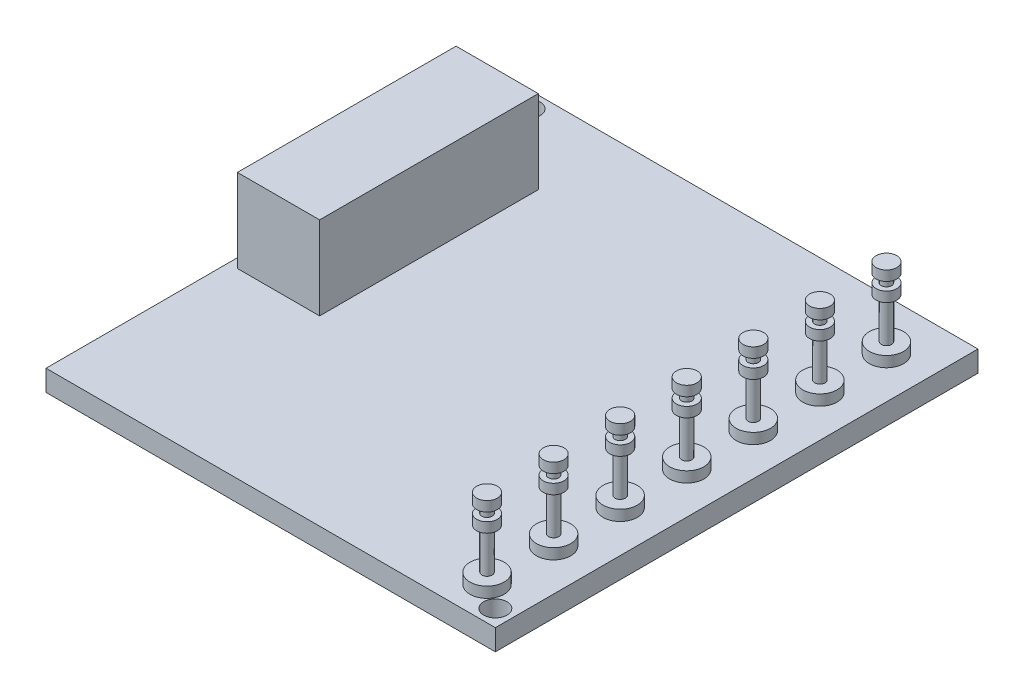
ISO-10303-21;
HEADER;
FILE_DESCRIPTION(('STEP AP214'),'2;1');
FILE_NAME('part.step','',(''),(''),'','','');
FILE_SCHEMA(('AUTOMOTIVE_DESIGN { 1 0 10303 214 1 1 1 1 }'));
ENDSEC;
DATA;
#1=APPLICATION_CONTEXT('core data for automotive mechanical design processes');
#2=APPLICATION_PROTOCOL_DEFINITION('international standard','automotive_design',2000,#1);
#3=PRODUCT_CONTEXT('',#1,'mechanical');
#4=PRODUCT('Part','Part','',(#3));
#5=PRODUCT_RELATED_PRODUCT_CATEGORY('part','',(#4));
#6=PRODUCT_DEFINITION_FORMATION('','',#4);
#7=PRODUCT_DEFINITION_CONTEXT('part definition',#1,'design');
#8=PRODUCT_DEFINITION('design','',#6,#7);
#9=PRODUCT_DEFINITION_SHAPE('','',#8);
#10=(LENGTH_UNIT() NAMED_UNIT(*) SI_UNIT(.MILLI.,.METRE.));
#11=(NAMED_UNIT(*) PLANE_ANGLE_UNIT() SI_UNIT($,.RADIAN.));
#12=(NAMED_UNIT(*) SI_UNIT($,.STERADIAN.) SOLID_ANGLE_UNIT());
#13=UNCERTAINTY_MEASURE_WITH_UNIT(LENGTH_MEASURE(1.E-05),#10,'distance_accuracy_value','');
#14=(GEOMETRIC_REPRESENTATION_CONTEXT(3) GLOBAL_UNCERTAINTY_ASSIGNED_CONTEXT((#13)) GLOBAL_UNIT_ASSIGNED_CONTEXT((#10,
#11,#12)) REPRESENTATION_CONTEXT('',''));
#15=CARTESIAN_POINT('',(0.,0.,0.));
#16=DIRECTION('',(0.,0.,1.));
#17=DIRECTION('',(1.,0.,0.));
#18=AXIS2_PLACEMENT_3D('',#15,#16,#17);
#19=CARTESIAN_POINT('',(0.,1.60019999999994,0.));
#20=DIRECTION('',(0.,-1.,0.));
#21=DIRECTION('',(0.,0.,-1.));
#22=AXIS2_PLACEMENT_3D('',#19,#20,#21);
#23=PLANE('',#22);
#24=CARTESIAN_POINT('',(13.97,1.60019999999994,-14.605));
#25=DIRECTION('',(0.,-1.,0.));
#26=DIRECTION('',(0.,0.,-1.));
#27=AXIS2_PLACEMENT_3D('',#24,#25,#26);
#28=CIRCLE('',#27,1.3081);
#29=CARTESIAN_POINT('',(13.97,1.60019999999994,-15.9131));
#30=VERTEX_POINT('',#29);
#31=EDGE_CURVE('E11',#30,#30,#28,.F.);
#32=ORIENTED_EDGE('',*,*,#31,.F.);
#33=EDGE_LOOP('',(#32));
#34=FACE_BOUND('',#33,.T.);
#35=CARTESIAN_POINT('',(13.97,1.60019999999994,-9.525));
#36=DIRECTION('',(0.,-1.,0.));
#37=DIRECTION('',(0.,0.,-1.));
#38=AXIS2_PLACEMENT_3D('',#35,#36,#37);
#39=CIRCLE('',#38,1.3081);
#40=CARTESIAN_POINT('',(13.97,1.60019999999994,-10.8331));
#41=VERTEX_POINT('',#40);
#42=EDGE_CURVE('E42',#41,#41,#39,.F.);
#43=ORIENTED_EDGE('',*,*,#42,.F.);
#44=EDGE_LOOP('',(#43));
#45=FACE_BOUND('',#44,.T.);
#46=CARTESIAN_POINT('',(13.97,1.60019999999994,-4.445));
#47=DIRECTION('',(0.,-1.,0.));
#48=DIRECTION('',(0.,0.,-1.));
#49=AXIS2_PLACEMENT_3D('',#46,#47,#48);
#50=CIRCLE('',#49,1.3081);
#51=CARTESIAN_POINT('',(13.97,1.60019999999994,-5.7531));
#52=VERTEX_POINT('',#51);
#53=EDGE_CURVE('E167',#52,#52,#50,.F.);
#54=ORIENTED_EDGE('',*,*,#53,.F.);
#55=EDGE_LOOP('',(#54));
#56=FACE_BOUND('',#55,.T.);
#57=CARTESIAN_POINT('',(13.97,1.60019999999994,0.634999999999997));
#58=DIRECTION('',(0.,-1.,0.));
#59=DIRECTION('',(0.,0.,-1.));
#60=AXIS2_PLACEMENT_3D('',#57,#58,#59);
#61=CIRCLE('',#60,1.3081);
#62=CARTESIAN_POINT('',(13.97,1.60019999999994,-0.673100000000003));
#63=VERTEX_POINT('',#62);
#64=EDGE_CURVE('E164',#63,#63,#61,.F.);
#65=ORIENTED_EDGE('',*,*,#64,.F.);
#66=EDGE_LOOP('',(#65));
#67=FACE_BOUND('',#66,.T.);
#68=CARTESIAN_POINT('',(13.97,1.60019999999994,5.71500000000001));
#69=DIRECTION('',(0.,-1.,0.));
#70=DIRECTION('',(0.,0.,-1.));
#71=AXIS2_PLACEMENT_3D('',#68,#69,#70);
#72=CIRCLE('',#71,1.3081);
#73=CARTESIAN_POINT('',(13.97,1.60019999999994,4.40690000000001));
#74=VERTEX_POINT('',#73);
#75=EDGE_CURVE('E161',#74,#74,#72,.F.);
#76=ORIENTED_EDGE('',*,*,#75,.F.);
#77=EDGE_LOOP('',(#76));
#78=FACE_BOUND('',#77,.T.);
#79=CARTESIAN_POINT('',(13.97,1.60019999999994,10.795));
#80=DIRECTION('',(0.,-1.,0.));
#81=DIRECTION('',(0.,0.,-1.));
#82=AXIS2_PLACEMENT_3D('',#79,#80,#81);
#83=CIRCLE('',#82,1.3081);
#84=CARTESIAN_POINT('',(13.97,1.60019999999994,9.4869));
#85=VERTEX_POINT('',#84);
#86=EDGE_CURVE('E158',#85,#85,#83,.F.);
#87=ORIENTED_EDGE('',*,*,#86,.F.);
#88=EDGE_LOOP('',(#87));
#89=FACE_BOUND('',#88,.T.);
#90=CARTESIAN_POINT('',(13.97,1.60019999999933,15.875));
#91=DIRECTION('',(0.,-1.,0.));
#92=DIRECTION('',(0.,0.,-1.));
#93=AXIS2_PLACEMENT_3D('',#90,#91,#92);
#94=CIRCLE('',#93,1.3081);
#95=CARTESIAN_POINT('',(13.97,1.60019999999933,14.5669));
#96=VERTEX_POINT('',#95);
#97=EDGE_CURVE('E155',#96,#96,#94,.F.);
#98=ORIENTED_EDGE('',*,*,#97,.F.);
#99=EDGE_LOOP('',(#98));
#100=FACE_BOUND('',#99,.T.);
#101=CARTESIAN_POINT('',(-15.875,1.60019999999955,-17.145));
#102=DIRECTION('',(0.,1.,0.));
#103=DIRECTION('',(0.,0.,1.));
#104=AXIS2_PLACEMENT_3D('',#101,#102,#103);
#105=CIRCLE('',#104,0.888999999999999);
#106=CARTESIAN_POINT('',(-15.875,1.60019999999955,-16.256));
#107=VERTEX_POINT('',#106);
#108=EDGE_CURVE('E192',#107,#107,#105,.T.);
#109=ORIENTED_EDGE('',*,*,#108,.F.);
#110=EDGE_LOOP('',(#109));
#111=FACE_BOUND('',#110,.T.);
#112=CARTESIAN_POINT('',(15.875,1.60019999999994,17.145));
#113=DIRECTION('',(0.,1.,0.));
#114=DIRECTION('',(0.,0.,1.));
#115=AXIS2_PLACEMENT_3D('',#112,#113,#114);
#116=CIRCLE('',#115,0.889000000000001);
#117=CARTESIAN_POINT('',(15.875,1.60019999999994,18.034));
#118=VERTEX_POINT('',#117);
#119=EDGE_CURVE('E196',#118,#118,#116,.T.);
#120=ORIENTED_EDGE('',*,*,#119,.F.);
#121=EDGE_LOOP('',(#120));
#122=FACE_BOUND('',#121,.T.);
#123=DIRECTION('',(0.,0.,-1.));
#124=VECTOR('',#123,1.);
#125=CARTESIAN_POINT('',(17.1449999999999,1.60019999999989,18.415));
#126=LINE('',#125,#124);
#127=CARTESIAN_POINT('',(17.1449999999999,1.60019999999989,18.415));
#128=VERTEX_POINT('',#127);
#129=CARTESIAN_POINT('',(17.145,1.60020000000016,-18.415));
#130=VERTEX_POINT('',#129);
#131=EDGE_CURVE('E129',#128,#130,#126,.T.);
#132=ORIENTED_EDGE('',*,*,#131,.T.);
#133=DIRECTION('',(-1.,0.,0.));
#134=VECTOR('',#133,1.);
#135=CARTESIAN_POINT('',(-17.1449999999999,1.60019999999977,-18.415));
#136=LINE('',#135,#134);
#137=CARTESIAN_POINT('',(-17.1449999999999,1.60019999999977,-18.415));
#138=VERTEX_POINT('',#137);
#139=EDGE_CURVE('E132',#130,#138,#136,.T.);
#140=ORIENTED_EDGE('',*,*,#139,.T.);
#141=DIRECTION('',(0.,0.,1.));
#142=VECTOR('',#141,1.);
#143=CARTESIAN_POINT('',(-17.145,1.60019999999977,18.415));
#144=LINE('',#143,#142);
#145=CARTESIAN_POINT('',(-17.145,1.60019999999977,18.415));
#146=VERTEX_POINT('',#145);
#147=EDGE_CURVE('E135',#138,#146,#144,.T.);
#148=ORIENTED_EDGE('',*,*,#147,.T.);
#149=DIRECTION('',(1.,0.,0.));
#150=VECTOR('',#149,1.);
#151=CARTESIAN_POINT('',(-17.145,1.60019999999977,18.415));
#152=LINE('',#151,#150);
#153=EDGE_CURVE('E137',#146,#128,#152,.T.);
#154=ORIENTED_EDGE('',*,*,#153,.T.);
#155=EDGE_LOOP('',(#132,#140,#148,#154));
#156=FACE_BOUND('',#155,.T.);
#157=DIRECTION('',(0.,0.,1.));
#158=VECTOR('',#157,1.);
#159=CARTESIAN_POINT('',(-16.4337999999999,1.60019999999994,-12.1666));
#160=LINE('',#159,#158);
#161=CARTESIAN_POINT('',(-16.4337999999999,1.60019999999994,-12.1666));
#162=VERTEX_POINT('',#161);
#163=CARTESIAN_POINT('',(-16.4337999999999,1.60019999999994,4.52120000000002));
#164=VERTEX_POINT('',#163);
#165=EDGE_CURVE('E119',#162,#164,#160,.T.);
#166=ORIENTED_EDGE('',*,*,#165,.F.);
#167=DIRECTION('',(-1.,0.,0.));
#168=VECTOR('',#167,1.);
#169=CARTESIAN_POINT('',(-16.4337999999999,1.60019999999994,-12.1666));
#170=LINE('',#169,#168);
#171=CARTESIAN_POINT('',(-10.16,1.6002000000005,-12.1666));
#172=VERTEX_POINT('',#171);
#173=EDGE_CURVE('E116',#172,#162,#170,.T.);
#174=ORIENTED_EDGE('',*,*,#173,.F.);
#175=DIRECTION('',(0.,0.,-1.));
#176=VECTOR('',#175,1.);
#177=CARTESIAN_POINT('',(-10.16,1.6002000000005,-12.1666));
#178=LINE('',#177,#176);
#179=CARTESIAN_POINT('',(-10.16,1.6002000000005,4.5212));
#180=VERTEX_POINT('',#179);
#181=EDGE_CURVE('E54',#180,#172,#178,.T.);
#182=ORIENTED_EDGE('',*,*,#181,.F.);
#183=DIRECTION('',(1.,0.,0.));
#184=VECTOR('',#183,1.);
#185=CARTESIAN_POINT('',(-16.4337999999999,1.60019999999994,4.52120000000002));
#186=LINE('',#185,#184);
#187=EDGE_CURVE('E49',#164,#180,#186,.T.);
#188=ORIENTED_EDGE('',*,*,#187,.F.);
#189=EDGE_LOOP('',(#166,#174,#182,#188));
#190=FACE_BOUND('',#189,.T.);
#191=ADVANCED_FACE('F34',(#34,#45,#56,#67,#78,#89,#100,#111,#122,#156,#190),#23,.F.);
#192=CARTESIAN_POINT('',(17.1449999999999,1.60019999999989,18.415));
#193=DIRECTION('',(-1.,0.,0.));
#194=DIRECTION('',(0.,0.,1.));
#195=AXIS2_PLACEMENT_3D('',#192,#193,#194);
#196=PLANE('',#195);
#197=DIRECTION('',(0.,0.,-1.));
#198=VECTOR('',#197,1.);
#199=CARTESIAN_POINT('',(17.1449999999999,0.,18.415));
#200=LINE('',#199,#198);
#201=CARTESIAN_POINT('',(17.1449999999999,0.,18.415));
#202=VERTEX_POINT('',#201);
#203=CARTESIAN_POINT('',(17.145,0.,-18.415));
#204=VERTEX_POINT('',#203);
#205=EDGE_CURVE('E120',#202,#204,#200,.T.);
#206=ORIENTED_EDGE('',*,*,#205,.T.);
#207=DIRECTION('',(0.,-1.,0.));
#208=VECTOR('',#207,1.);
#209=CARTESIAN_POINT('',(17.145,1.60020000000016,-18.415));
#210=LINE('',#209,#208);
#211=EDGE_CURVE('E152',#130,#204,#210,.T.);
#212=ORIENTED_EDGE('',*,*,#211,.F.);
#213=ORIENTED_EDGE('',*,*,#131,.F.);
#214=DIRECTION('',(0.,-1.,0.));
#215=VECTOR('',#214,1.);
#216=CARTESIAN_POINT('',(17.1449999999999,1.60019999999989,18.415));
#217=LINE('',#216,#215);
#218=EDGE_CURVE('E138',#128,#202,#217,.T.);
#219=ORIENTED_EDGE('',*,*,#218,.T.);
#220=EDGE_LOOP('',(#206,#212,#213,#219));
#221=FACE_BOUND('',#220,.T.);
#222=ADVANCED_FACE('F36',(#221),#196,.F.);
#223=CARTESIAN_POINT('',(-17.1449999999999,1.60019999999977,-18.415));
#224=DIRECTION('',(0.,0.,1.));
#225=DIRECTION('',(1.,0.,0.));
#226=AXIS2_PLACEMENT_3D('',#223,#224,#225);
#227=PLANE('',#226);
#228=DIRECTION('',(-1.,0.,0.));
#229=VECTOR('',#228,1.);
#230=CARTESIAN_POINT('',(-17.145,-6.66133814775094E-13,-18.415));
#231=LINE('',#230,#229);
#232=CARTESIAN_POINT('',(-17.145,-6.66133814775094E-13,-18.415));
#233=VERTEX_POINT('',#232);
#234=EDGE_CURVE('E123',#204,#233,#231,.T.);
#235=ORIENTED_EDGE('',*,*,#234,.T.);
#236=DIRECTION('',(0.,-1.,0.));
#237=VECTOR('',#236,1.);
#238=CARTESIAN_POINT('',(-17.1449999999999,1.60019999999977,-18.415));
#239=LINE('',#238,#237);
#240=EDGE_CURVE('E149',#138,#233,#239,.T.);
#241=ORIENTED_EDGE('',*,*,#240,.F.);
#242=ORIENTED_EDGE('',*,*,#139,.F.);
#243=ORIENTED_EDGE('',*,*,#211,.T.);
#244=EDGE_LOOP('',(#235,#241,#242,#243));
#245=FACE_BOUND('',#244,.T.);
#246=ADVANCED_FACE('F736',(#245),#227,.F.);
#247=CARTESIAN_POINT('',(-17.145,1.60019999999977,18.415));
#248=DIRECTION('',(1.,0.,0.));
#249=DIRECTION('',(0.,0.,-1.));
#250=AXIS2_PLACEMENT_3D('',#247,#248,#249);
#251=PLANE('',#250);
#252=DIRECTION('',(0.,0.,1.));
#253=VECTOR('',#252,1.);
#254=CARTESIAN_POINT('',(-17.145,-9.99200722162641E-13,18.415));
#255=LINE('',#254,#253);
#256=CARTESIAN_POINT('',(-17.145,-9.99200722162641E-13,18.415));
#257=VERTEX_POINT('',#256);
#258=EDGE_CURVE('E141',#233,#257,#255,.T.);
#259=ORIENTED_EDGE('',*,*,#258,.T.);
#260=DIRECTION('',(0.,-1.,0.));
#261=VECTOR('',#260,1.);
#262=CARTESIAN_POINT('',(-17.145,1.60019999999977,18.415));
#263=LINE('',#262,#261);
#264=EDGE_CURVE('E146',#146,#257,#263,.T.);
#265=ORIENTED_EDGE('',*,*,#264,.F.);
#266=ORIENTED_EDGE('',*,*,#147,.F.);
#267=ORIENTED_EDGE('',*,*,#240,.T.);
#268=EDGE_LOOP('',(#259,#265,#266,#267));
#269=FACE_BOUND('',#268,.T.);
#270=ADVANCED_FACE('F733',(#269),#251,.F.);
#271=CARTESIAN_POINT('',(-17.145,1.60019999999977,18.415));
#272=DIRECTION('',(0.,0.,-1.));
#273=DIRECTION('',(-1.,0.,0.));
#274=AXIS2_PLACEMENT_3D('',#271,#272,#273);
#275=PLANE('',#274);
#276=DIRECTION('',(1.,0.,0.));
#277=VECTOR('',#276,1.);
#278=CARTESIAN_POINT('',(-17.145,-9.99200722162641E-13,18.415));
#279=LINE('',#278,#277);
#280=EDGE_CURVE('E133',#257,#202,#279,.T.);
#281=ORIENTED_EDGE('',*,*,#280,.T.);
#282=ORIENTED_EDGE('',*,*,#218,.F.);
#283=ORIENTED_EDGE('',*,*,#153,.F.);
#284=ORIENTED_EDGE('',*,*,#264,.T.);
#285=EDGE_LOOP('',(#281,#282,#283,#284));
#286=FACE_BOUND('',#285,.T.);
#287=ADVANCED_FACE('F729',(#286),#275,.F.);
#288=CARTESIAN_POINT('',(0.,0.,0.));
#289=DIRECTION('',(0.,-1.,0.));
#290=DIRECTION('',(0.,0.,-1.));
#291=AXIS2_PLACEMENT_3D('',#288,#289,#290);
#292=PLANE('',#291);
#293=CARTESIAN_POINT('',(-15.875,0.,-17.145));
#294=DIRECTION('',(0.,-1.,0.));
#295=DIRECTION('',(0.,0.,-1.));
#296=AXIS2_PLACEMENT_3D('',#293,#294,#295);
#297=CIRCLE('',#296,0.888999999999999);
#298=CARTESIAN_POINT('',(-15.875,0.,-18.034));
#299=VERTEX_POINT('',#298);
#300=EDGE_CURVE('E223',#299,#299,#297,.T.);
#301=ORIENTED_EDGE('',*,*,#300,.F.);
#302=EDGE_LOOP('',(#301));
#303=FACE_BOUND('',#302,.T.);
#304=CARTESIAN_POINT('',(15.8749999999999,-1.16573417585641E-12,17.145));
#305=DIRECTION('',(0.,-1.,0.));
#306=DIRECTION('',(0.,0.,-1.));
#307=AXIS2_PLACEMENT_3D('',#304,#305,#306);
#308=CIRCLE('',#307,0.889000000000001);
#309=CARTESIAN_POINT('',(15.8749999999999,-1.16573417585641E-12,16.256));
#310=VERTEX_POINT('',#309);
#311=EDGE_CURVE('E217',#310,#310,#308,.T.);
#312=ORIENTED_EDGE('',*,*,#311,.F.);
#313=EDGE_LOOP('',(#312));
#314=FACE_BOUND('',#313,.T.);
#315=CARTESIAN_POINT('',(-10.6273654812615,-2.22044604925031E-13,-5.99049327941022));
#316=DIRECTION('',(0.,-1.,0.));
#317=DIRECTION('',(0.,0.,-1.));
#318=AXIS2_PLACEMENT_3D('',#315,#316,#317);
#319=CIRCLE('',#318,0.32766);
#320=CARTESIAN_POINT('',(-10.6273654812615,-2.22044604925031E-13,-6.31815327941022));
#321=VERTEX_POINT('',#320);
#322=EDGE_CURVE('E214',#321,#321,#319,.T.);
#323=ORIENTED_EDGE('',*,*,#322,.F.);
#324=EDGE_LOOP('',(#323));
#325=FACE_BOUND('',#324,.T.);
#326=ORIENTED_EDGE('',*,*,#205,.F.);
#327=ORIENTED_EDGE('',*,*,#280,.F.);
#328=ORIENTED_EDGE('',*,*,#258,.F.);
#329=ORIENTED_EDGE('',*,*,#234,.F.);
#330=EDGE_LOOP('',(#326,#327,#328,#329));
#331=FACE_BOUND('',#330,.T.);
#332=ADVANCED_FACE('F725',(#303,#314,#325,#331),#292,.T.);
#333=CARTESIAN_POINT('',(-16.4338,7.95020000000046,-12.1666));
#334=DIRECTION('',(1.,0.,0.));
#335=DIRECTION('',(0.,0.,-1.));
#336=AXIS2_PLACEMENT_3D('',#333,#334,#335);
#337=PLANE('',#336);
#338=ORIENTED_EDGE('',*,*,#165,.T.);
#339=DIRECTION('',(0.,-1.,0.));
#340=VECTOR('',#339,1.);
#341=CARTESIAN_POINT('',(-16.4337999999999,7.95020000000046,4.52120000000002));
#342=LINE('',#341,#340);
#343=CARTESIAN_POINT('',(-16.4337999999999,7.95020000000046,4.52120000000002));
#344=VERTEX_POINT('',#343);
#345=EDGE_CURVE('E100',#344,#164,#342,.T.);
#346=ORIENTED_EDGE('',*,*,#345,.F.);
#347=DIRECTION('',(0.,0.,1.));
#348=VECTOR('',#347,1.);
#349=CARTESIAN_POINT('',(-16.4338,7.95020000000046,-12.1666));
#350=LINE('',#349,#348);
#351=CARTESIAN_POINT('',(-16.4338,7.95020000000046,-12.1666));
#352=VERTEX_POINT('',#351);
#353=EDGE_CURVE('E107',#352,#344,#350,.T.);
#354=ORIENTED_EDGE('',*,*,#353,.F.);
#355=DIRECTION('',(0.,-1.,0.));
#356=VECTOR('',#355,1.);
#357=CARTESIAN_POINT('',(-16.4338,7.95020000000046,-12.1666));
#358=LINE('',#357,#356);
#359=EDGE_CURVE('E205',#352,#162,#358,.T.);
#360=ORIENTED_EDGE('',*,*,#359,.T.);
#361=EDGE_LOOP('',(#338,#346,#354,#360));
#362=FACE_BOUND('',#361,.T.);
#363=ADVANCED_FACE('F118',(#362),#337,.F.);
#364=CARTESIAN_POINT('',(-16.4337999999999,7.95020000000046,4.52120000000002));
#365=DIRECTION('',(0.,0.,-1.));
#366=DIRECTION('',(-1.,0.,0.));
#367=AXIS2_PLACEMENT_3D('',#364,#365,#366);
#368=PLANE('',#367);
#369=ORIENTED_EDGE('',*,*,#187,.T.);
#370=DIRECTION('',(0.,-1.,0.));
#371=VECTOR('',#370,1.);
#372=CARTESIAN_POINT('',(-10.16,7.95019999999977,4.52120000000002));
#373=LINE('',#372,#371);
#374=CARTESIAN_POINT('',(-10.16,7.95019999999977,4.52120000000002));
#375=VERTEX_POINT('',#374);
#376=EDGE_CURVE('E103',#375,#180,#373,.T.);
#377=ORIENTED_EDGE('',*,*,#376,.F.);
#378=DIRECTION('',(1.,0.,0.));
#379=VECTOR('',#378,1.);
#380=CARTESIAN_POINT('',(-16.4337999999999,7.95020000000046,4.52120000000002));
#381=LINE('',#380,#379);
#382=EDGE_CURVE('E96',#344,#375,#381,.T.);
#383=ORIENTED_EDGE('',*,*,#382,.F.);
#384=ORIENTED_EDGE('',*,*,#345,.T.);
#385=EDGE_LOOP('',(#369,#377,#383,#384));
#386=FACE_BOUND('',#385,.T.);
#387=ADVANCED_FACE('F98',(#386),#368,.F.);
#388=CARTESIAN_POINT('',(-10.16,7.95020000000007,-12.1666));
#389=DIRECTION('',(-1.,0.,0.));
#390=DIRECTION('',(0.,0.,1.));
#391=AXIS2_PLACEMENT_3D('',#388,#389,#390);
#392=PLANE('',#391);
#393=ORIENTED_EDGE('',*,*,#181,.T.);
#394=DIRECTION('',(0.,-1.,0.));
#395=VECTOR('',#394,1.);
#396=CARTESIAN_POINT('',(-10.16,7.95020000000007,-12.1666));
#397=LINE('',#396,#395);
#398=CARTESIAN_POINT('',(-10.16,7.95020000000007,-12.1666));
#399=VERTEX_POINT('',#398);
#400=EDGE_CURVE('E125',#399,#172,#397,.T.);
#401=ORIENTED_EDGE('',*,*,#400,.F.);
#402=DIRECTION('',(0.,0.,-1.));
#403=VECTOR('',#402,1.);
#404=CARTESIAN_POINT('',(-10.16,7.95020000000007,-12.1666));
#405=LINE('',#404,#403);
#406=EDGE_CURVE('E106',#375,#399,#405,.T.);
#407=ORIENTED_EDGE('',*,*,#406,.F.);
#408=ORIENTED_EDGE('',*,*,#376,.T.);
#409=EDGE_LOOP('',(#393,#401,#407,#408));
#410=FACE_BOUND('',#409,.T.);
#411=ADVANCED_FACE('F718',(#410),#392,.F.);
#412=CARTESIAN_POINT('',(-16.4338,7.95020000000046,-12.1666));
#413=DIRECTION('',(0.,0.,1.));
#414=DIRECTION('',(1.,0.,0.));
#415=AXIS2_PLACEMENT_3D('',#412,#413,#414);
#416=PLANE('',#415);
#417=ORIENTED_EDGE('',*,*,#173,.T.);
#418=ORIENTED_EDGE('',*,*,#359,.F.);
#419=DIRECTION('',(-1.,0.,0.));
#420=VECTOR('',#419,1.);
#421=CARTESIAN_POINT('',(-16.4338,7.95020000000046,-12.1666));
#422=LINE('',#421,#420);
#423=EDGE_CURVE('E112',#399,#352,#422,.T.);
#424=ORIENTED_EDGE('',*,*,#423,.F.);
#425=ORIENTED_EDGE('',*,*,#400,.T.);
#426=EDGE_LOOP('',(#417,#418,#424,#425));
#427=FACE_BOUND('',#426,.T.);
#428=ADVANCED_FACE('F204',(#427),#416,.F.);
#429=CARTESIAN_POINT('',(0.,7.95019999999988,0.));
#430=DIRECTION('',(0.,1.,0.));
#431=DIRECTION('',(0.,0.,1.));
#432=AXIS2_PLACEMENT_3D('',#429,#430,#431);
#433=PLANE('',#432);
#434=ORIENTED_EDGE('',*,*,#353,.T.);
#435=ORIENTED_EDGE('',*,*,#382,.T.);
#436=ORIENTED_EDGE('',*,*,#406,.T.);
#437=ORIENTED_EDGE('',*,*,#423,.T.);
#438=EDGE_LOOP('',(#434,#435,#436,#437));
#439=FACE_BOUND('',#438,.T.);
#440=ADVANCED_FACE('F110',(#439),#433,.T.);
#441=CARTESIAN_POINT('',(-10.6273654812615,-1.47320000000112,-5.99049327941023));
#442=DIRECTION('',(0.,1.,0.));
#443=DIRECTION('',(0.,0.,1.));
#444=AXIS2_PLACEMENT_3D('',#441,#442,#443);
#445=CYLINDRICAL_SURFACE('',#444,0.32766);
#446=CARTESIAN_POINT('',(-10.6273654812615,-1.47320000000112,-5.99049327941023));
#447=DIRECTION('',(0.,-1.,0.));
#448=DIRECTION('',(0.,0.,-1.));
#449=AXIS2_PLACEMENT_3D('',#446,#447,#448);
#450=CIRCLE('',#449,0.32766);
#451=CARTESIAN_POINT('',(-10.6273654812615,-1.47320000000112,-6.31815327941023));
#452=VERTEX_POINT('',#451);
#453=EDGE_CURVE('E200',#452,#452,#450,.T.);
#454=ORIENTED_EDGE('',*,*,#453,.F.);
#455=EDGE_LOOP('',(#454));
#456=FACE_BOUND('',#455,.T.);
#457=ORIENTED_EDGE('',*,*,#322,.T.);
#458=EDGE_LOOP('',(#457));
#459=FACE_BOUND('',#458,.T.);
#460=ADVANCED_FACE('F709',(#456,#459),#445,.T.);
#461=CARTESIAN_POINT('',(-10.6273654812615,-1.47320000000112,-5.99049327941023));
#462=DIRECTION('',(0.,-1.,0.));
#463=DIRECTION('',(0.,0.,-1.));
#464=AXIS2_PLACEMENT_3D('',#461,#462,#463);
#465=PLANE('',#464);
#466=ORIENTED_EDGE('',*,*,#453,.T.);
#467=EDGE_LOOP('',(#466));
#468=FACE_BOUND('',#467,.T.);
#469=ADVANCED_FACE('F705',(#468),#465,.T.);
#470=CARTESIAN_POINT('',(15.875,1.60019999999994,17.145));
#471=DIRECTION('',(0.,1.,0.));
#472=DIRECTION('',(0.,0.,1.));
#473=AXIS2_PLACEMENT_3D('',#470,#471,#472);
#474=CYLINDRICAL_SURFACE('',#473,0.889000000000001);
#475=ORIENTED_EDGE('',*,*,#311,.T.);
#476=EDGE_LOOP('',(#475));
#477=FACE_BOUND('',#476,.T.);
#478=ORIENTED_EDGE('',*,*,#119,.T.);
#479=EDGE_LOOP('',(#478));
#480=FACE_BOUND('',#479,.T.);
#481=ADVANCED_FACE('F701',(#477,#480),#474,.F.);
#482=CARTESIAN_POINT('',(-15.875,1.60019999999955,-17.145));
#483=DIRECTION('',(0.,1.,0.));
#484=DIRECTION('',(0.,0.,1.));
#485=AXIS2_PLACEMENT_3D('',#482,#483,#484);
#486=CYLINDRICAL_SURFACE('',#485,0.888999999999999);
#487=ORIENTED_EDGE('',*,*,#300,.T.);
#488=EDGE_LOOP('',(#487));
#489=FACE_BOUND('',#488,.T.);
#490=ORIENTED_EDGE('',*,*,#108,.T.);
#491=EDGE_LOOP('',(#490));
#492=FACE_BOUND('',#491,.T.);
#493=ADVANCED_FACE('F697',(#489,#492),#486,.F.);
#494=CARTESIAN_POINT('',(13.97,1.60019999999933,15.875));
#495=DIRECTION('',(0.,-1.,0.));
#496=DIRECTION('',(0.,0.,-1.));
#497=AXIS2_PLACEMENT_3D('',#494,#495,#496);
#498=CYLINDRICAL_SURFACE('',#497,1.3081);
#499=ORIENTED_EDGE('',*,*,#97,.T.);
#500=EDGE_LOOP('',(#499));
#501=FACE_BOUND('',#500,.T.);
#502=CARTESIAN_POINT('',(13.97,2.413,15.875));
#503=DIRECTION('',(0.,-1.,0.));
#504=DIRECTION('',(0.,0.,-1.));
#505=AXIS2_PLACEMENT_3D('',#502,#503,#504);
#506=CIRCLE('',#505,1.3081);
#507=CARTESIAN_POINT('',(13.97,2.413,14.5669));
#508=VERTEX_POINT('',#507);
#509=EDGE_CURVE('E227',#508,#508,#506,.T.);
#510=ORIENTED_EDGE('',*,*,#509,.T.);
#511=EDGE_LOOP('',(#510));
#512=FACE_BOUND('',#511,.T.);
#513=ADVANCED_FACE('F693',(#501,#512),#498,.T.);
#514=CARTESIAN_POINT('',(13.97,2.413,17.1831));
#515=DIRECTION('',(0.,-1.,0.));
#516=DIRECTION('',(0.,0.,-1.));
#517=AXIS2_PLACEMENT_3D('',#514,#515,#516);
#518=PLANE('',#517);
#519=ORIENTED_EDGE('',*,*,#509,.F.);
#520=EDGE_LOOP('',(#519));
#521=FACE_BOUND('',#520,.T.);
#522=CARTESIAN_POINT('',(13.97,2.413,15.875));
#523=DIRECTION('',(0.,-1.,0.));
#524=DIRECTION('',(0.,0.,-1.));
#525=AXIS2_PLACEMENT_3D('',#522,#523,#524);
#526=CIRCLE('',#525,0.3937);
#527=CARTESIAN_POINT('',(13.97,2.413,15.4813));
#528=VERTEX_POINT('',#527);
#529=EDGE_CURVE('E230',#528,#528,#526,.T.);
#530=ORIENTED_EDGE('',*,*,#529,.T.);
#531=EDGE_LOOP('',(#530));
#532=FACE_BOUND('',#531,.T.);
#533=ADVANCED_FACE('F689',(#521,#532),#518,.F.);
#534=CARTESIAN_POINT('',(13.97,1.60019999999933,15.875));
#535=DIRECTION('',(0.,-1.,0.));
#536=DIRECTION('',(0.,0.,-1.));
#537=AXIS2_PLACEMENT_3D('',#534,#535,#536);
#538=CYLINDRICAL_SURFACE('',#537,0.3937);
#539=ORIENTED_EDGE('',*,*,#529,.F.);
#540=EDGE_LOOP('',(#539));
#541=FACE_BOUND('',#540,.T.);
#542=CARTESIAN_POINT('',(13.97,5.53719999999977,15.875));
#543=DIRECTION('',(0.,-1.,0.));
#544=DIRECTION('',(0.,0.,-1.));
#545=AXIS2_PLACEMENT_3D('',#542,#543,#544);
#546=CIRCLE('',#545,0.3937);
#547=CARTESIAN_POINT('',(13.97,5.53719999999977,15.4813));
#548=VERTEX_POINT('',#547);
#549=EDGE_CURVE('E233',#548,#548,#546,.T.);
#550=ORIENTED_EDGE('',*,*,#549,.T.);
#551=EDGE_LOOP('',(#550));
#552=FACE_BOUND('',#551,.T.);
#553=ADVANCED_FACE('F685',(#541,#552),#538,.T.);
#554=CARTESIAN_POINT('',(13.97,5.53719999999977,16.2687));
#555=DIRECTION('',(0.,1.,0.));
#556=DIRECTION('',(0.,0.,1.));
#557=AXIS2_PLACEMENT_3D('',#554,#555,#556);
#558=PLANE('',#557);
#559=ORIENTED_EDGE('',*,*,#549,.F.);
#560=EDGE_LOOP('',(#559));
#561=FACE_BOUND('',#560,.T.);
#562=CARTESIAN_POINT('',(13.97,5.53719999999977,15.875));
#563=DIRECTION('',(0.,-1.,0.));
#564=DIRECTION('',(0.,0.,-1.));
#565=AXIS2_PLACEMENT_3D('',#562,#563,#564);
#566=CIRCLE('',#565,0.787400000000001);
#567=CARTESIAN_POINT('',(13.97,5.53719999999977,15.0876));
#568=VERTEX_POINT('',#567);
#569=EDGE_CURVE('E236',#568,#568,#566,.T.);
#570=ORIENTED_EDGE('',*,*,#569,.T.);
#571=EDGE_LOOP('',(#570));
#572=FACE_BOUND('',#571,.T.);
#573=ADVANCED_FACE('F681',(#561,#572),#558,.F.);
#574=CARTESIAN_POINT('',(13.97,1.60019999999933,15.875));
#575=DIRECTION('',(0.,-1.,0.));
#576=DIRECTION('',(0.,0.,-1.));
#577=AXIS2_PLACEMENT_3D('',#574,#575,#576);
#578=CYLINDRICAL_SURFACE('',#577,0.787400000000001);
#579=ORIENTED_EDGE('',*,*,#569,.F.);
#580=EDGE_LOOP('',(#579));
#581=FACE_BOUND('',#580,.T.);
#582=CARTESIAN_POINT('',(13.9700000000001,6.29919999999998,15.875));
#583=DIRECTION('',(0.,-1.,0.));
#584=DIRECTION('',(0.,0.,-1.));
#585=AXIS2_PLACEMENT_3D('',#582,#583,#584);
#586=CIRCLE('',#585,0.787400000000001);
#587=CARTESIAN_POINT('',(13.9700000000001,6.29919999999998,15.0876));
#588=VERTEX_POINT('',#587);
#589=EDGE_CURVE('E239',#588,#588,#586,.T.);
#590=ORIENTED_EDGE('',*,*,#589,.T.);
#591=EDGE_LOOP('',(#590));
#592=FACE_BOUND('',#591,.T.);
#593=ADVANCED_FACE('F677',(#581,#592),#578,.T.);
#594=CARTESIAN_POINT('',(13.97,6.29919999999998,16.6624));
#595=DIRECTION('',(0.,-1.,0.));
#596=DIRECTION('',(0.,0.,-1.));
#597=AXIS2_PLACEMENT_3D('',#594,#595,#596);
#598=PLANE('',#597);
#599=ORIENTED_EDGE('',*,*,#589,.F.);
#600=EDGE_LOOP('',(#599));
#601=FACE_BOUND('',#600,.T.);
#602=CARTESIAN_POINT('',(13.9700000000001,6.29919999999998,15.875));
#603=DIRECTION('',(0.,-1.,0.));
#604=DIRECTION('',(0.,0.,-1.));
#605=AXIS2_PLACEMENT_3D('',#602,#603,#604);
#606=CIRCLE('',#605,0.3937);
#607=CARTESIAN_POINT('',(13.9700000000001,6.29919999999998,15.4813));
#608=VERTEX_POINT('',#607);
#609=EDGE_CURVE('E242',#608,#608,#606,.T.);
#610=ORIENTED_EDGE('',*,*,#609,.T.);
#611=EDGE_LOOP('',(#610));
#612=FACE_BOUND('',#611,.T.);
#613=ADVANCED_FACE('F673',(#601,#612),#598,.F.);
#614=CARTESIAN_POINT('',(13.97,1.60019999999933,15.875));
#615=DIRECTION('',(0.,-1.,0.));
#616=DIRECTION('',(0.,0.,-1.));
#617=AXIS2_PLACEMENT_3D('',#614,#615,#616);
#618=CYLINDRICAL_SURFACE('',#617,0.3937);
#619=ORIENTED_EDGE('',*,*,#609,.F.);
#620=EDGE_LOOP('',(#619));
#621=FACE_BOUND('',#620,.T.);
#622=CARTESIAN_POINT('',(13.97,6.93419999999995,15.875));
#623=DIRECTION('',(0.,-1.,0.));
#624=DIRECTION('',(0.,0.,-1.));
#625=AXIS2_PLACEMENT_3D('',#622,#623,#624);
#626=CIRCLE('',#625,0.3937);
#627=CARTESIAN_POINT('',(13.97,6.93419999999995,15.4813));
#628=VERTEX_POINT('',#627);
#629=EDGE_CURVE('E245',#628,#628,#626,.T.);
#630=ORIENTED_EDGE('',*,*,#629,.T.);
#631=EDGE_LOOP('',(#630));
#632=FACE_BOUND('',#631,.T.);
#633=ADVANCED_FACE('F669',(#621,#632),#618,.T.);
#634=CARTESIAN_POINT('',(13.97,6.9342,16.2687));
#635=DIRECTION('',(0.,1.,0.));
#636=DIRECTION('',(0.,0.,1.));
#637=AXIS2_PLACEMENT_3D('',#634,#635,#636);
#638=PLANE('',#637);
#639=ORIENTED_EDGE('',*,*,#629,.F.);
#640=EDGE_LOOP('',(#639));
#641=FACE_BOUND('',#640,.T.);
#642=CARTESIAN_POINT('',(13.97,6.93419999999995,15.875));
#643=DIRECTION('',(0.,-1.,0.));
#644=DIRECTION('',(0.,0.,-1.));
#645=AXIS2_PLACEMENT_3D('',#642,#643,#644);
#646=CIRCLE('',#645,0.787400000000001);
#647=CARTESIAN_POINT('',(13.97,6.93419999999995,15.0876));
#648=VERTEX_POINT('',#647);
#649=EDGE_CURVE('E248',#648,#648,#646,.T.);
#650=ORIENTED_EDGE('',*,*,#649,.T.);
#651=EDGE_LOOP('',(#650));
#652=FACE_BOUND('',#651,.T.);
#653=ADVANCED_FACE('F665',(#641,#652),#638,.F.);
#654=CARTESIAN_POINT('',(13.97,1.60019999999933,15.875));
#655=DIRECTION('',(0.,-1.,0.));
#656=DIRECTION('',(0.,0.,-1.));
#657=AXIS2_PLACEMENT_3D('',#654,#655,#656);
#658=CYLINDRICAL_SURFACE('',#657,0.787400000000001);
#659=ORIENTED_EDGE('',*,*,#649,.F.);
#660=EDGE_LOOP('',(#659));
#661=FACE_BOUND('',#660,.T.);
#662=CARTESIAN_POINT('',(13.97,7.69619999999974,15.875));
#663=DIRECTION('',(0.,-1.,0.));
#664=DIRECTION('',(0.,0.,-1.));
#665=AXIS2_PLACEMENT_3D('',#662,#663,#664);
#666=CIRCLE('',#665,0.787400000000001);
#667=CARTESIAN_POINT('',(13.97,7.69619999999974,15.0876));
#668=VERTEX_POINT('',#667);
#669=EDGE_CURVE('E251',#668,#668,#666,.T.);
#670=ORIENTED_EDGE('',*,*,#669,.T.);
#671=EDGE_LOOP('',(#670));
#672=FACE_BOUND('',#671,.T.);
#673=ADVANCED_FACE('F661',(#661,#672),#658,.T.);
#674=CARTESIAN_POINT('',(13.97,7.69619999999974,16.6624));
#675=DIRECTION('',(0.,-1.,0.));
#676=DIRECTION('',(0.,0.,-1.));
#677=AXIS2_PLACEMENT_3D('',#674,#675,#676);
#678=PLANE('',#677);
#679=ORIENTED_EDGE('',*,*,#669,.F.);
#680=EDGE_LOOP('',(#679));
#681=FACE_BOUND('',#680,.T.);
#682=ADVANCED_FACE('F657',(#681),#678,.F.);
#683=CARTESIAN_POINT('',(13.97,1.60019999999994,10.795));
#684=DIRECTION('',(0.,-1.,0.));
#685=DIRECTION('',(0.,0.,-1.));
#686=AXIS2_PLACEMENT_3D('',#683,#684,#685);
#687=CYLINDRICAL_SURFACE('',#686,1.3081);
#688=ORIENTED_EDGE('',*,*,#86,.T.);
#689=EDGE_LOOP('',(#688));
#690=FACE_BOUND('',#689,.T.);
#691=CARTESIAN_POINT('',(13.97,2.413,10.795));
#692=DIRECTION('',(0.,-1.,0.));
#693=DIRECTION('',(0.,0.,-1.));
#694=AXIS2_PLACEMENT_3D('',#691,#692,#693);
#695=CIRCLE('',#694,1.3081);
#696=CARTESIAN_POINT('',(13.97,2.413,9.48690000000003));
#697=VERTEX_POINT('',#696);
#698=EDGE_CURVE('E254',#697,#697,#695,.T.);
#699=ORIENTED_EDGE('',*,*,#698,.T.);
#700=EDGE_LOOP('',(#699));
#701=FACE_BOUND('',#700,.T.);
#702=ADVANCED_FACE('F653',(#690,#701),#687,.T.);
#703=CARTESIAN_POINT('',(13.97,2.413,12.1031));
#704=DIRECTION('',(0.,-1.,0.));
#705=DIRECTION('',(0.,0.,-1.));
#706=AXIS2_PLACEMENT_3D('',#703,#704,#705);
#707=PLANE('',#706);
#708=ORIENTED_EDGE('',*,*,#698,.F.);
#709=EDGE_LOOP('',(#708));
#710=FACE_BOUND('',#709,.T.);
#711=CARTESIAN_POINT('',(13.97,2.413,10.795));
#712=DIRECTION('',(0.,-1.,0.));
#713=DIRECTION('',(0.,0.,-1.));
#714=AXIS2_PLACEMENT_3D('',#711,#712,#713);
#715=CIRCLE('',#714,0.3937);
#716=CARTESIAN_POINT('',(13.97,2.413,10.4013));
#717=VERTEX_POINT('',#716);
#718=EDGE_CURVE('E257',#717,#717,#715,.T.);
#719=ORIENTED_EDGE('',*,*,#718,.T.);
#720=EDGE_LOOP('',(#719));
#721=FACE_BOUND('',#720,.T.);
#722=ADVANCED_FACE('F649',(#710,#721),#707,.F.);
#723=CARTESIAN_POINT('',(13.97,1.60019999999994,10.795));
#724=DIRECTION('',(0.,-1.,0.));
#725=DIRECTION('',(0.,0.,-1.));
#726=AXIS2_PLACEMENT_3D('',#723,#724,#725);
#727=CYLINDRICAL_SURFACE('',#726,0.3937);
#728=ORIENTED_EDGE('',*,*,#718,.F.);
#729=EDGE_LOOP('',(#728));
#730=FACE_BOUND('',#729,.T.);
#731=CARTESIAN_POINT('',(13.97,5.53719999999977,10.795));
#732=DIRECTION('',(0.,-1.,0.));
#733=DIRECTION('',(0.,0.,-1.));
#734=AXIS2_PLACEMENT_3D('',#731,#732,#733);
#735=CIRCLE('',#734,0.3937);
#736=CARTESIAN_POINT('',(13.97,5.53719999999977,10.4013));
#737=VERTEX_POINT('',#736);
#738=EDGE_CURVE('E260',#737,#737,#735,.T.);
#739=ORIENTED_EDGE('',*,*,#738,.T.);
#740=EDGE_LOOP('',(#739));
#741=FACE_BOUND('',#740,.T.);
#742=ADVANCED_FACE('F645',(#730,#741),#727,.T.);
#743=CARTESIAN_POINT('',(13.97,5.53719999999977,11.1887));
#744=DIRECTION('',(0.,1.,0.));
#745=DIRECTION('',(0.,0.,1.));
#746=AXIS2_PLACEMENT_3D('',#743,#744,#745);
#747=PLANE('',#746);
#748=ORIENTED_EDGE('',*,*,#738,.F.);
#749=EDGE_LOOP('',(#748));
#750=FACE_BOUND('',#749,.T.);
#751=CARTESIAN_POINT('',(13.97,5.53719999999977,10.795));
#752=DIRECTION('',(0.,-1.,0.));
#753=DIRECTION('',(0.,0.,-1.));
#754=AXIS2_PLACEMENT_3D('',#751,#752,#753);
#755=CIRCLE('',#754,0.787400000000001);
#756=CARTESIAN_POINT('',(13.97,5.53719999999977,10.0076));
#757=VERTEX_POINT('',#756);
#758=EDGE_CURVE('E263',#757,#757,#755,.T.);
#759=ORIENTED_EDGE('',*,*,#758,.T.);
#760=EDGE_LOOP('',(#759));
#761=FACE_BOUND('',#760,.T.);
#762=ADVANCED_FACE('F641',(#750,#761),#747,.F.);
#763=CARTESIAN_POINT('',(13.97,1.60019999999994,10.795));
#764=DIRECTION('',(0.,-1.,0.));
#765=DIRECTION('',(0.,0.,-1.));
#766=AXIS2_PLACEMENT_3D('',#763,#764,#765);
#767=CYLINDRICAL_SURFACE('',#766,0.787400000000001);
#768=ORIENTED_EDGE('',*,*,#758,.F.);
#769=EDGE_LOOP('',(#768));
#770=FACE_BOUND('',#769,.T.);
#771=CARTESIAN_POINT('',(13.9700000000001,6.29919999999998,10.795));
#772=DIRECTION('',(0.,-1.,0.));
#773=DIRECTION('',(0.,0.,-1.));
#774=AXIS2_PLACEMENT_3D('',#771,#772,#773);
#775=CIRCLE('',#774,0.787400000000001);
#776=CARTESIAN_POINT('',(13.9700000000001,6.29919999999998,10.0076));
#777=VERTEX_POINT('',#776);
#778=EDGE_CURVE('E266',#777,#777,#775,.T.);
#779=ORIENTED_EDGE('',*,*,#778,.T.);
#780=EDGE_LOOP('',(#779));
#781=FACE_BOUND('',#780,.T.);
#782=ADVANCED_FACE('F637',(#770,#781),#767,.T.);
#783=CARTESIAN_POINT('',(13.97,6.29919999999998,11.5824));
#784=DIRECTION('',(0.,-1.,0.));
#785=DIRECTION('',(0.,0.,-1.));
#786=AXIS2_PLACEMENT_3D('',#783,#784,#785);
#787=PLANE('',#786);
#788=ORIENTED_EDGE('',*,*,#778,.F.);
#789=EDGE_LOOP('',(#788));
#790=FACE_BOUND('',#789,.T.);
#791=CARTESIAN_POINT('',(13.9700000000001,6.29919999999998,10.795));
#792=DIRECTION('',(0.,-1.,0.));
#793=DIRECTION('',(0.,0.,-1.));
#794=AXIS2_PLACEMENT_3D('',#791,#792,#793);
#795=CIRCLE('',#794,0.3937);
#796=CARTESIAN_POINT('',(13.9700000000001,6.29919999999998,10.4013));
#797=VERTEX_POINT('',#796);
#798=EDGE_CURVE('E269',#797,#797,#795,.T.);
#799=ORIENTED_EDGE('',*,*,#798,.T.);
#800=EDGE_LOOP('',(#799));
#801=FACE_BOUND('',#800,.T.);
#802=ADVANCED_FACE('F633',(#790,#801),#787,.F.);
#803=CARTESIAN_POINT('',(13.97,1.60019999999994,10.795));
#804=DIRECTION('',(0.,-1.,0.));
#805=DIRECTION('',(0.,0.,-1.));
#806=AXIS2_PLACEMENT_3D('',#803,#804,#805);
#807=CYLINDRICAL_SURFACE('',#806,0.3937);
#808=ORIENTED_EDGE('',*,*,#798,.F.);
#809=EDGE_LOOP('',(#808));
#810=FACE_BOUND('',#809,.T.);
#811=CARTESIAN_POINT('',(13.97,6.9342,10.795));
#812=DIRECTION('',(0.,-1.,0.));
#813=DIRECTION('',(0.,0.,-1.));
#814=AXIS2_PLACEMENT_3D('',#811,#812,#813);
#815=CIRCLE('',#814,0.3937);
#816=CARTESIAN_POINT('',(13.97,6.9342,10.4013));
#817=VERTEX_POINT('',#816);
#818=EDGE_CURVE('E272',#817,#817,#815,.T.);
#819=ORIENTED_EDGE('',*,*,#818,.T.);
#820=EDGE_LOOP('',(#819));
#821=FACE_BOUND('',#820,.T.);
#822=ADVANCED_FACE('F629',(#810,#821),#807,.T.);
#823=CARTESIAN_POINT('',(13.97,6.9342,11.1887));
#824=DIRECTION('',(0.,1.,0.));
#825=DIRECTION('',(0.,0.,1.));
#826=AXIS2_PLACEMENT_3D('',#823,#824,#825);
#827=PLANE('',#826);
#828=ORIENTED_EDGE('',*,*,#818,.F.);
#829=EDGE_LOOP('',(#828));
#830=FACE_BOUND('',#829,.T.);
#831=CARTESIAN_POINT('',(13.97,6.9342,10.795));
#832=DIRECTION('',(0.,-1.,0.));
#833=DIRECTION('',(0.,0.,-1.));
#834=AXIS2_PLACEMENT_3D('',#831,#832,#833);
#835=CIRCLE('',#834,0.787400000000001);
#836=CARTESIAN_POINT('',(13.97,6.9342,10.0076));
#837=VERTEX_POINT('',#836);
#838=EDGE_CURVE('E275',#837,#837,#835,.T.);
#839=ORIENTED_EDGE('',*,*,#838,.T.);
#840=EDGE_LOOP('',(#839));
#841=FACE_BOUND('',#840,.T.);
#842=ADVANCED_FACE('F625',(#830,#841),#827,.F.);
#843=CARTESIAN_POINT('',(13.97,1.60019999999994,10.795));
#844=DIRECTION('',(0.,-1.,0.));
#845=DIRECTION('',(0.,0.,-1.));
#846=AXIS2_PLACEMENT_3D('',#843,#844,#845);
#847=CYLINDRICAL_SURFACE('',#846,0.787400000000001);
#848=ORIENTED_EDGE('',*,*,#838,.F.);
#849=EDGE_LOOP('',(#848));
#850=FACE_BOUND('',#849,.T.);
#851=CARTESIAN_POINT('',(13.97,7.69619999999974,10.795));
#852=DIRECTION('',(0.,-1.,0.));
#853=DIRECTION('',(0.,0.,-1.));
#854=AXIS2_PLACEMENT_3D('',#851,#852,#853);
#855=CIRCLE('',#854,0.787400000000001);
#856=CARTESIAN_POINT('',(13.97,7.69619999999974,10.0076));
#857=VERTEX_POINT('',#856);
#858=EDGE_CURVE('E278',#857,#857,#855,.T.);
#859=ORIENTED_EDGE('',*,*,#858,.T.);
#860=EDGE_LOOP('',(#859));
#861=FACE_BOUND('',#860,.T.);
#862=ADVANCED_FACE('F621',(#850,#861),#847,.T.);
#863=CARTESIAN_POINT('',(13.97,7.69619999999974,11.5824));
#864=DIRECTION('',(0.,-1.,0.));
#865=DIRECTION('',(0.,0.,-1.));
#866=AXIS2_PLACEMENT_3D('',#863,#864,#865);
#867=PLANE('',#866);
#868=ORIENTED_EDGE('',*,*,#858,.F.);
#869=EDGE_LOOP('',(#868));
#870=FACE_BOUND('',#869,.T.);
#871=ADVANCED_FACE('F617',(#870),#867,.F.);
#872=CARTESIAN_POINT('',(13.97,1.60019999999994,5.71500000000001));
#873=DIRECTION('',(0.,-1.,0.));
#874=DIRECTION('',(0.,0.,-1.));
#875=AXIS2_PLACEMENT_3D('',#872,#873,#874);
#876=CYLINDRICAL_SURFACE('',#875,1.3081);
#877=ORIENTED_EDGE('',*,*,#75,.T.);
#878=EDGE_LOOP('',(#877));
#879=FACE_BOUND('',#878,.T.);
#880=CARTESIAN_POINT('',(13.97,2.413,5.715));
#881=DIRECTION('',(0.,-1.,0.));
#882=DIRECTION('',(0.,0.,-1.));
#883=AXIS2_PLACEMENT_3D('',#880,#881,#882);
#884=CIRCLE('',#883,1.3081);
#885=CARTESIAN_POINT('',(13.97,2.413,4.4069));
#886=VERTEX_POINT('',#885);
#887=EDGE_CURVE('E281',#886,#886,#884,.T.);
#888=ORIENTED_EDGE('',*,*,#887,.T.);
#889=EDGE_LOOP('',(#888));
#890=FACE_BOUND('',#889,.T.);
#891=ADVANCED_FACE('F613',(#879,#890),#876,.T.);
#892=CARTESIAN_POINT('',(13.97,2.413,7.0231));
#893=DIRECTION('',(0.,-1.,0.));
#894=DIRECTION('',(0.,0.,-1.));
#895=AXIS2_PLACEMENT_3D('',#892,#893,#894);
#896=PLANE('',#895);
#897=ORIENTED_EDGE('',*,*,#887,.F.);
#898=EDGE_LOOP('',(#897));
#899=FACE_BOUND('',#898,.T.);
#900=CARTESIAN_POINT('',(13.97,2.413,5.715));
#901=DIRECTION('',(0.,-1.,0.));
#902=DIRECTION('',(0.,0.,-1.));
#903=AXIS2_PLACEMENT_3D('',#900,#901,#902);
#904=CIRCLE('',#903,0.3937);
#905=CARTESIAN_POINT('',(13.97,2.413,5.3213));
#906=VERTEX_POINT('',#905);
#907=EDGE_CURVE('E284',#906,#906,#904,.T.);
#908=ORIENTED_EDGE('',*,*,#907,.T.);
#909=EDGE_LOOP('',(#908));
#910=FACE_BOUND('',#909,.T.);
#911=ADVANCED_FACE('F609',(#899,#910),#896,.F.);
#912=CARTESIAN_POINT('',(13.97,1.60019999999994,5.71500000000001));
#913=DIRECTION('',(0.,-1.,0.));
#914=DIRECTION('',(0.,0.,-1.));
#915=AXIS2_PLACEMENT_3D('',#912,#913,#914);
#916=CYLINDRICAL_SURFACE('',#915,0.3937);
#917=ORIENTED_EDGE('',*,*,#907,.F.);
#918=EDGE_LOOP('',(#917));
#919=FACE_BOUND('',#918,.T.);
#920=CARTESIAN_POINT('',(13.97,5.53719999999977,5.715));
#921=DIRECTION('',(0.,-1.,0.));
#922=DIRECTION('',(0.,0.,-1.));
#923=AXIS2_PLACEMENT_3D('',#920,#921,#922);
#924=CIRCLE('',#923,0.3937);
#925=CARTESIAN_POINT('',(13.97,5.53719999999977,5.3213));
#926=VERTEX_POINT('',#925);
#927=EDGE_CURVE('E287',#926,#926,#924,.T.);
#928=ORIENTED_EDGE('',*,*,#927,.T.);
#929=EDGE_LOOP('',(#928));
#930=FACE_BOUND('',#929,.T.);
#931=ADVANCED_FACE('F605',(#919,#930),#916,.T.);
#932=CARTESIAN_POINT('',(13.97,5.53719999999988,6.1087));
#933=DIRECTION('',(0.,1.,0.));
#934=DIRECTION('',(0.,0.,1.));
#935=AXIS2_PLACEMENT_3D('',#932,#933,#934);
#936=PLANE('',#935);
#937=ORIENTED_EDGE('',*,*,#927,.F.);
#938=EDGE_LOOP('',(#937));
#939=FACE_BOUND('',#938,.T.);
#940=CARTESIAN_POINT('',(13.97,5.53719999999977,5.715));
#941=DIRECTION('',(0.,-1.,0.));
#942=DIRECTION('',(0.,0.,-1.));
#943=AXIS2_PLACEMENT_3D('',#940,#941,#942);
#944=CIRCLE('',#943,0.787400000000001);
#945=CARTESIAN_POINT('',(13.97,5.53719999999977,4.9276));
#946=VERTEX_POINT('',#945);
#947=EDGE_CURVE('E290',#946,#946,#944,.T.);
#948=ORIENTED_EDGE('',*,*,#947,.T.);
#949=EDGE_LOOP('',(#948));
#950=FACE_BOUND('',#949,.T.);
#951=ADVANCED_FACE('F601',(#939,#950),#936,.F.);
#952=CARTESIAN_POINT('',(13.97,1.60019999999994,5.71500000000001));
#953=DIRECTION('',(0.,-1.,0.));
#954=DIRECTION('',(0.,0.,-1.));
#955=AXIS2_PLACEMENT_3D('',#952,#953,#954);
#956=CYLINDRICAL_SURFACE('',#955,0.787400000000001);
#957=ORIENTED_EDGE('',*,*,#947,.F.);
#958=EDGE_LOOP('',(#957));
#959=FACE_BOUND('',#958,.T.);
#960=CARTESIAN_POINT('',(13.97,6.29919999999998,5.71500000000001));
#961=DIRECTION('',(0.,-1.,0.));
#962=DIRECTION('',(0.,0.,-1.));
#963=AXIS2_PLACEMENT_3D('',#960,#961,#962);
#964=CIRCLE('',#963,0.787400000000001);
#965=CARTESIAN_POINT('',(13.97,6.29919999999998,4.92760000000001));
#966=VERTEX_POINT('',#965);
#967=EDGE_CURVE('E293',#966,#966,#964,.T.);
#968=ORIENTED_EDGE('',*,*,#967,.T.);
#969=EDGE_LOOP('',(#968));
#970=FACE_BOUND('',#969,.T.);
#971=ADVANCED_FACE('F597',(#959,#970),#956,.T.);
#972=CARTESIAN_POINT('',(13.97,6.29919999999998,6.50240000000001));
#973=DIRECTION('',(0.,-1.,0.));
#974=DIRECTION('',(0.,0.,-1.));
#975=AXIS2_PLACEMENT_3D('',#972,#973,#974);
#976=PLANE('',#975);
#977=ORIENTED_EDGE('',*,*,#967,.F.);
#978=EDGE_LOOP('',(#977));
#979=FACE_BOUND('',#978,.T.);
#980=CARTESIAN_POINT('',(13.97,6.29919999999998,5.71500000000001));
#981=DIRECTION('',(0.,-1.,0.));
#982=DIRECTION('',(0.,0.,-1.));
#983=AXIS2_PLACEMENT_3D('',#980,#981,#982);
#984=CIRCLE('',#983,0.3937);
#985=CARTESIAN_POINT('',(13.97,6.29919999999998,5.32130000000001));
#986=VERTEX_POINT('',#985);
#987=EDGE_CURVE('E296',#986,#986,#984,.T.);
#988=ORIENTED_EDGE('',*,*,#987,.T.);
#989=EDGE_LOOP('',(#988));
#990=FACE_BOUND('',#989,.T.);
#991=ADVANCED_FACE('F593',(#979,#990),#976,.F.);
#992=CARTESIAN_POINT('',(13.97,1.60019999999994,5.71500000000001));
#993=DIRECTION('',(0.,-1.,0.));
#994=DIRECTION('',(0.,0.,-1.));
#995=AXIS2_PLACEMENT_3D('',#992,#993,#994);
#996=CYLINDRICAL_SURFACE('',#995,0.3937);
#997=ORIENTED_EDGE('',*,*,#987,.F.);
#998=EDGE_LOOP('',(#997));
#999=FACE_BOUND('',#998,.T.);
#1000=CARTESIAN_POINT('',(13.97,6.9342,5.71500000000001));
#1001=DIRECTION('',(0.,-1.,0.));
#1002=DIRECTION('',(0.,0.,-1.));
#1003=AXIS2_PLACEMENT_3D('',#1000,#1001,#1002);
#1004=CIRCLE('',#1003,0.3937);
#1005=CARTESIAN_POINT('',(13.97,6.9342,5.32130000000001));
#1006=VERTEX_POINT('',#1005);
#1007=EDGE_CURVE('E299',#1006,#1006,#1004,.T.);
#1008=ORIENTED_EDGE('',*,*,#1007,.T.);
#1009=EDGE_LOOP('',(#1008));
#1010=FACE_BOUND('',#1009,.T.);
#1011=ADVANCED_FACE('F589',(#999,#1010),#996,.T.);
#1012=CARTESIAN_POINT('',(13.97,6.9342,6.10870000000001));
#1013=DIRECTION('',(0.,1.,0.));
#1014=DIRECTION('',(0.,0.,1.));
#1015=AXIS2_PLACEMENT_3D('',#1012,#1013,#1014);
#1016=PLANE('',#1015);
#1017=ORIENTED_EDGE('',*,*,#1007,.F.);
#1018=EDGE_LOOP('',(#1017));
#1019=FACE_BOUND('',#1018,.T.);
#1020=CARTESIAN_POINT('',(13.97,6.9342,5.71500000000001));
#1021=DIRECTION('',(0.,-1.,0.));
#1022=DIRECTION('',(0.,0.,-1.));
#1023=AXIS2_PLACEMENT_3D('',#1020,#1021,#1022);
#1024=CIRCLE('',#1023,0.787400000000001);
#1025=CARTESIAN_POINT('',(13.97,6.9342,4.92760000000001));
#1026=VERTEX_POINT('',#1025);
#1027=EDGE_CURVE('E302',#1026,#1026,#1024,.T.);
#1028=ORIENTED_EDGE('',*,*,#1027,.T.);
#1029=EDGE_LOOP('',(#1028));
#1030=FACE_BOUND('',#1029,.T.);
#1031=ADVANCED_FACE('F585',(#1019,#1030),#1016,.F.);
#1032=CARTESIAN_POINT('',(13.97,1.60019999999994,5.71500000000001));
#1033=DIRECTION('',(0.,-1.,0.));
#1034=DIRECTION('',(0.,0.,-1.));
#1035=AXIS2_PLACEMENT_3D('',#1032,#1033,#1034);
#1036=CYLINDRICAL_SURFACE('',#1035,0.787400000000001);
#1037=ORIENTED_EDGE('',*,*,#1027,.F.);
#1038=EDGE_LOOP('',(#1037));
#1039=FACE_BOUND('',#1038,.T.);
#1040=CARTESIAN_POINT('',(13.97,7.69619999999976,5.715));
#1041=DIRECTION('',(0.,-1.,0.));
#1042=DIRECTION('',(0.,0.,-1.));
#1043=AXIS2_PLACEMENT_3D('',#1040,#1041,#1042);
#1044=CIRCLE('',#1043,0.787400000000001);
#1045=CARTESIAN_POINT('',(13.97,7.69619999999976,4.9276));
#1046=VERTEX_POINT('',#1045);
#1047=EDGE_CURVE('E305',#1046,#1046,#1044,.T.);
#1048=ORIENTED_EDGE('',*,*,#1047,.T.);
#1049=EDGE_LOOP('',(#1048));
#1050=FACE_BOUND('',#1049,.T.);
#1051=ADVANCED_FACE('F581',(#1039,#1050),#1036,.T.);
#1052=CARTESIAN_POINT('',(13.97,7.69619999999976,6.5024));
#1053=DIRECTION('',(0.,-1.,0.));
#1054=DIRECTION('',(0.,0.,-1.));
#1055=AXIS2_PLACEMENT_3D('',#1052,#1053,#1054);
#1056=PLANE('',#1055);
#1057=ORIENTED_EDGE('',*,*,#1047,.F.);
#1058=EDGE_LOOP('',(#1057));
#1059=FACE_BOUND('',#1058,.T.);
#1060=ADVANCED_FACE('F577',(#1059),#1056,.F.);
#1061=CARTESIAN_POINT('',(13.97,1.60019999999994,0.634999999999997));
#1062=DIRECTION('',(0.,-1.,0.));
#1063=DIRECTION('',(0.,0.,-1.));
#1064=AXIS2_PLACEMENT_3D('',#1061,#1062,#1063);
#1065=CYLINDRICAL_SURFACE('',#1064,1.3081);
#1066=ORIENTED_EDGE('',*,*,#64,.T.);
#1067=EDGE_LOOP('',(#1066));
#1068=FACE_BOUND('',#1067,.T.);
#1069=CARTESIAN_POINT('',(13.97,2.413,0.635000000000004));
#1070=DIRECTION('',(0.,-1.,0.));
#1071=DIRECTION('',(0.,0.,-1.));
#1072=AXIS2_PLACEMENT_3D('',#1069,#1070,#1071);
#1073=CIRCLE('',#1072,1.3081);
#1074=CARTESIAN_POINT('',(13.97,2.413,-0.673099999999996));
#1075=VERTEX_POINT('',#1074);
#1076=EDGE_CURVE('E308',#1075,#1075,#1073,.T.);
#1077=ORIENTED_EDGE('',*,*,#1076,.T.);
#1078=EDGE_LOOP('',(#1077));
#1079=FACE_BOUND('',#1078,.T.);
#1080=ADVANCED_FACE('F573',(#1068,#1079),#1065,.T.);
#1081=CARTESIAN_POINT('',(13.97,2.413,1.94310000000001));
#1082=DIRECTION('',(0.,-1.,0.));
#1083=DIRECTION('',(0.,0.,-1.));
#1084=AXIS2_PLACEMENT_3D('',#1081,#1082,#1083);
#1085=PLANE('',#1084);
#1086=ORIENTED_EDGE('',*,*,#1076,.F.);
#1087=EDGE_LOOP('',(#1086));
#1088=FACE_BOUND('',#1087,.T.);
#1089=CARTESIAN_POINT('',(13.97,2.413,0.635000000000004));
#1090=DIRECTION('',(0.,-1.,0.));
#1091=DIRECTION('',(0.,0.,-1.));
#1092=AXIS2_PLACEMENT_3D('',#1089,#1090,#1091);
#1093=CIRCLE('',#1092,0.3937);
#1094=CARTESIAN_POINT('',(13.97,2.413,0.241300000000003));
#1095=VERTEX_POINT('',#1094);
#1096=EDGE_CURVE('E311',#1095,#1095,#1093,.T.);
#1097=ORIENTED_EDGE('',*,*,#1096,.T.);
#1098=EDGE_LOOP('',(#1097));
#1099=FACE_BOUND('',#1098,.T.);
#1100=ADVANCED_FACE('F569',(#1088,#1099),#1085,.F.);
#1101=CARTESIAN_POINT('',(13.97,1.60019999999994,0.634999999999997));
#1102=DIRECTION('',(0.,-1.,0.));
#1103=DIRECTION('',(0.,0.,-1.));
#1104=AXIS2_PLACEMENT_3D('',#1101,#1102,#1103);
#1105=CYLINDRICAL_SURFACE('',#1104,0.3937);
#1106=ORIENTED_EDGE('',*,*,#1096,.F.);
#1107=EDGE_LOOP('',(#1106));
#1108=FACE_BOUND('',#1107,.T.);
#1109=CARTESIAN_POINT('',(13.97,5.53719999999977,0.634999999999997));
#1110=DIRECTION('',(0.,-1.,0.));
#1111=DIRECTION('',(0.,0.,-1.));
#1112=AXIS2_PLACEMENT_3D('',#1109,#1110,#1111);
#1113=CIRCLE('',#1112,0.3937);
#1114=CARTESIAN_POINT('',(13.97,5.53719999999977,0.241299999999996));
#1115=VERTEX_POINT('',#1114);
#1116=EDGE_CURVE('E314',#1115,#1115,#1113,.T.);
#1117=ORIENTED_EDGE('',*,*,#1116,.T.);
#1118=EDGE_LOOP('',(#1117));
#1119=FACE_BOUND('',#1118,.T.);
#1120=ADVANCED_FACE('F565',(#1108,#1119),#1105,.T.);
#1121=CARTESIAN_POINT('',(13.97,5.53719999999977,1.0287));
#1122=DIRECTION('',(0.,1.,0.));
#1123=DIRECTION('',(0.,0.,1.));
#1124=AXIS2_PLACEMENT_3D('',#1121,#1122,#1123);
#1125=PLANE('',#1124);
#1126=ORIENTED_EDGE('',*,*,#1116,.F.);
#1127=EDGE_LOOP('',(#1126));
#1128=FACE_BOUND('',#1127,.T.);
#1129=CARTESIAN_POINT('',(13.97,5.53719999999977,0.634999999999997));
#1130=DIRECTION('',(0.,-1.,0.));
#1131=DIRECTION('',(0.,0.,-1.));
#1132=AXIS2_PLACEMENT_3D('',#1129,#1130,#1131);
#1133=CIRCLE('',#1132,0.787400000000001);
#1134=CARTESIAN_POINT('',(13.97,5.53719999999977,-0.152400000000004));
#1135=VERTEX_POINT('',#1134);
#1136=EDGE_CURVE('E317',#1135,#1135,#1133,.T.);
#1137=ORIENTED_EDGE('',*,*,#1136,.T.);
#1138=EDGE_LOOP('',(#1137));
#1139=FACE_BOUND('',#1138,.T.);
#1140=ADVANCED_FACE('F561',(#1128,#1139),#1125,.F.);
#1141=CARTESIAN_POINT('',(13.97,1.60019999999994,0.634999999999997));
#1142=DIRECTION('',(0.,-1.,0.));
#1143=DIRECTION('',(0.,0.,-1.));
#1144=AXIS2_PLACEMENT_3D('',#1141,#1142,#1143);
#1145=CYLINDRICAL_SURFACE('',#1144,0.787400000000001);
#1146=ORIENTED_EDGE('',*,*,#1136,.F.);
#1147=EDGE_LOOP('',(#1146));
#1148=FACE_BOUND('',#1147,.T.);
#1149=CARTESIAN_POINT('',(13.97,6.2992,0.634999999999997));
#1150=DIRECTION('',(0.,-1.,0.));
#1151=DIRECTION('',(0.,0.,-1.));
#1152=AXIS2_PLACEMENT_3D('',#1149,#1150,#1151);
#1153=CIRCLE('',#1152,0.787400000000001);
#1154=CARTESIAN_POINT('',(13.97,6.2992,-0.152400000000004));
#1155=VERTEX_POINT('',#1154);
#1156=EDGE_CURVE('E320',#1155,#1155,#1153,.T.);
#1157=ORIENTED_EDGE('',*,*,#1156,.T.);
#1158=EDGE_LOOP('',(#1157));
#1159=FACE_BOUND('',#1158,.T.);
#1160=ADVANCED_FACE('F557',(#1148,#1159),#1145,.T.);
#1161=CARTESIAN_POINT('',(13.97,6.2992,1.4224));
#1162=DIRECTION('',(0.,-1.,0.));
#1163=DIRECTION('',(0.,0.,-1.));
#1164=AXIS2_PLACEMENT_3D('',#1161,#1162,#1163);
#1165=PLANE('',#1164);
#1166=ORIENTED_EDGE('',*,*,#1156,.F.);
#1167=EDGE_LOOP('',(#1166));
#1168=FACE_BOUND('',#1167,.T.);
#1169=CARTESIAN_POINT('',(13.97,6.2992,0.634999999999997));
#1170=DIRECTION('',(0.,-1.,0.));
#1171=DIRECTION('',(0.,0.,-1.));
#1172=AXIS2_PLACEMENT_3D('',#1169,#1170,#1171);
#1173=CIRCLE('',#1172,0.3937);
#1174=CARTESIAN_POINT('',(13.97,6.2992,0.241299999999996));
#1175=VERTEX_POINT('',#1174);
#1176=EDGE_CURVE('E323',#1175,#1175,#1173,.T.);
#1177=ORIENTED_EDGE('',*,*,#1176,.T.);
#1178=EDGE_LOOP('',(#1177));
#1179=FACE_BOUND('',#1178,.T.);
#1180=ADVANCED_FACE('F553',(#1168,#1179),#1165,.F.);
#1181=CARTESIAN_POINT('',(13.97,1.60019999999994,0.634999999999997));
#1182=DIRECTION('',(0.,-1.,0.));
#1183=DIRECTION('',(0.,0.,-1.));
#1184=AXIS2_PLACEMENT_3D('',#1181,#1182,#1183);
#1185=CYLINDRICAL_SURFACE('',#1184,0.3937);
#1186=ORIENTED_EDGE('',*,*,#1176,.F.);
#1187=EDGE_LOOP('',(#1186));
#1188=FACE_BOUND('',#1187,.T.);
#1189=CARTESIAN_POINT('',(13.97,6.9342,0.635000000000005));
#1190=DIRECTION('',(0.,-1.,0.));
#1191=DIRECTION('',(0.,0.,-1.));
#1192=AXIS2_PLACEMENT_3D('',#1189,#1190,#1191);
#1193=CIRCLE('',#1192,0.3937);
#1194=CARTESIAN_POINT('',(13.97,6.9342,0.241300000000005));
#1195=VERTEX_POINT('',#1194);
#1196=EDGE_CURVE('E326',#1195,#1195,#1193,.T.);
#1197=ORIENTED_EDGE('',*,*,#1196,.T.);
#1198=EDGE_LOOP('',(#1197));
#1199=FACE_BOUND('',#1198,.T.);
#1200=ADVANCED_FACE('F549',(#1188,#1199),#1185,.T.);
#1201=CARTESIAN_POINT('',(13.97,6.9342,1.02870000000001));
#1202=DIRECTION('',(0.,1.,0.));
#1203=DIRECTION('',(0.,0.,1.));
#1204=AXIS2_PLACEMENT_3D('',#1201,#1202,#1203);
#1205=PLANE('',#1204);
#1206=ORIENTED_EDGE('',*,*,#1196,.F.);
#1207=EDGE_LOOP('',(#1206));
#1208=FACE_BOUND('',#1207,.T.);
#1209=CARTESIAN_POINT('',(13.97,6.9342,0.635000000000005));
#1210=DIRECTION('',(0.,-1.,0.));
#1211=DIRECTION('',(0.,0.,-1.));
#1212=AXIS2_PLACEMENT_3D('',#1209,#1210,#1211);
#1213=CIRCLE('',#1212,0.787400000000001);
#1214=CARTESIAN_POINT('',(13.97,6.9342,-0.152399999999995));
#1215=VERTEX_POINT('',#1214);
#1216=EDGE_CURVE('E329',#1215,#1215,#1213,.T.);
#1217=ORIENTED_EDGE('',*,*,#1216,.T.);
#1218=EDGE_LOOP('',(#1217));
#1219=FACE_BOUND('',#1218,.T.);
#1220=ADVANCED_FACE('F545',(#1208,#1219),#1205,.F.);
#1221=CARTESIAN_POINT('',(13.97,1.60019999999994,0.634999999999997));
#1222=DIRECTION('',(0.,-1.,0.));
#1223=DIRECTION('',(0.,0.,-1.));
#1224=AXIS2_PLACEMENT_3D('',#1221,#1222,#1223);
#1225=CYLINDRICAL_SURFACE('',#1224,0.787400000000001);
#1226=ORIENTED_EDGE('',*,*,#1216,.F.);
#1227=EDGE_LOOP('',(#1226));
#1228=FACE_BOUND('',#1227,.T.);
#1229=CARTESIAN_POINT('',(13.97,7.69619999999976,0.635000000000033));
#1230=DIRECTION('',(0.,-1.,0.));
#1231=DIRECTION('',(0.,0.,-1.));
#1232=AXIS2_PLACEMENT_3D('',#1229,#1230,#1231);
#1233=CIRCLE('',#1232,0.787400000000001);
#1234=CARTESIAN_POINT('',(13.97,7.69619999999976,-0.152399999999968));
#1235=VERTEX_POINT('',#1234);
#1236=EDGE_CURVE('E332',#1235,#1235,#1233,.T.);
#1237=ORIENTED_EDGE('',*,*,#1236,.T.);
#1238=EDGE_LOOP('',(#1237));
#1239=FACE_BOUND('',#1238,.T.);
#1240=ADVANCED_FACE('F541',(#1228,#1239),#1225,.T.);
#1241=CARTESIAN_POINT('',(13.97,7.69619999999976,1.42240000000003));
#1242=DIRECTION('',(0.,-1.,0.));
#1243=DIRECTION('',(0.,0.,-1.));
#1244=AXIS2_PLACEMENT_3D('',#1241,#1242,#1243);
#1245=PLANE('',#1244);
#1246=ORIENTED_EDGE('',*,*,#1236,.F.);
#1247=EDGE_LOOP('',(#1246));
#1248=FACE_BOUND('',#1247,.T.);
#1249=ADVANCED_FACE('F537',(#1248),#1245,.F.);
#1250=CARTESIAN_POINT('',(13.97,1.60019999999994,-4.445));
#1251=DIRECTION('',(0.,-1.,0.));
#1252=DIRECTION('',(0.,0.,-1.));
#1253=AXIS2_PLACEMENT_3D('',#1250,#1251,#1252);
#1254=CYLINDRICAL_SURFACE('',#1253,1.3081);
#1255=ORIENTED_EDGE('',*,*,#53,.T.);
#1256=EDGE_LOOP('',(#1255));
#1257=FACE_BOUND('',#1256,.T.);
#1258=CARTESIAN_POINT('',(13.97,2.413,-4.445));
#1259=DIRECTION('',(0.,-1.,0.));
#1260=DIRECTION('',(0.,0.,-1.));
#1261=AXIS2_PLACEMENT_3D('',#1258,#1259,#1260);
#1262=CIRCLE('',#1261,1.3081);
#1263=CARTESIAN_POINT('',(13.97,2.413,-5.7531));
#1264=VERTEX_POINT('',#1263);
#1265=EDGE_CURVE('E335',#1264,#1264,#1262,.T.);
#1266=ORIENTED_EDGE('',*,*,#1265,.T.);
#1267=EDGE_LOOP('',(#1266));
#1268=FACE_BOUND('',#1267,.T.);
#1269=ADVANCED_FACE('F533',(#1257,#1268),#1254,.T.);
#1270=CARTESIAN_POINT('',(13.97,2.413,-3.1369));
#1271=DIRECTION('',(0.,-1.,0.));
#1272=DIRECTION('',(0.,0.,-1.));
#1273=AXIS2_PLACEMENT_3D('',#1270,#1271,#1272);
#1274=PLANE('',#1273);
#1275=ORIENTED_EDGE('',*,*,#1265,.F.);
#1276=EDGE_LOOP('',(#1275));
#1277=FACE_BOUND('',#1276,.T.);
#1278=CARTESIAN_POINT('',(13.97,2.413,-4.445));
#1279=DIRECTION('',(0.,-1.,0.));
#1280=DIRECTION('',(0.,0.,-1.));
#1281=AXIS2_PLACEMENT_3D('',#1278,#1279,#1280);
#1282=CIRCLE('',#1281,0.3937);
#1283=CARTESIAN_POINT('',(13.97,2.413,-4.8387));
#1284=VERTEX_POINT('',#1283);
#1285=EDGE_CURVE('E338',#1284,#1284,#1282,.T.);
#1286=ORIENTED_EDGE('',*,*,#1285,.T.);
#1287=EDGE_LOOP('',(#1286));
#1288=FACE_BOUND('',#1287,.T.);
#1289=ADVANCED_FACE('F529',(#1277,#1288),#1274,.F.);
#1290=CARTESIAN_POINT('',(13.97,1.60019999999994,-4.445));
#1291=DIRECTION('',(0.,-1.,0.));
#1292=DIRECTION('',(0.,0.,-1.));
#1293=AXIS2_PLACEMENT_3D('',#1290,#1291,#1292);
#1294=CYLINDRICAL_SURFACE('',#1293,0.3937);
#1295=ORIENTED_EDGE('',*,*,#1285,.F.);
#1296=EDGE_LOOP('',(#1295));
#1297=FACE_BOUND('',#1296,.T.);
#1298=CARTESIAN_POINT('',(13.97,5.53719999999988,-4.445));
#1299=DIRECTION('',(0.,-1.,0.));
#1300=DIRECTION('',(0.,0.,-1.));
#1301=AXIS2_PLACEMENT_3D('',#1298,#1299,#1300);
#1302=CIRCLE('',#1301,0.3937);
#1303=CARTESIAN_POINT('',(13.97,5.53719999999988,-4.8387));
#1304=VERTEX_POINT('',#1303);
#1305=EDGE_CURVE('E341',#1304,#1304,#1302,.T.);
#1306=ORIENTED_EDGE('',*,*,#1305,.T.);
#1307=EDGE_LOOP('',(#1306));
#1308=FACE_BOUND('',#1307,.T.);
#1309=ADVANCED_FACE('F525',(#1297,#1308),#1294,.T.);
#1310=CARTESIAN_POINT('',(13.97,5.53719999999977,-4.0513));
#1311=DIRECTION('',(0.,1.,0.));
#1312=DIRECTION('',(0.,0.,1.));
#1313=AXIS2_PLACEMENT_3D('',#1310,#1311,#1312);
#1314=PLANE('',#1313);
#1315=ORIENTED_EDGE('',*,*,#1305,.F.);
#1316=EDGE_LOOP('',(#1315));
#1317=FACE_BOUND('',#1316,.T.);
#1318=CARTESIAN_POINT('',(13.97,5.53719999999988,-4.445));
#1319=DIRECTION('',(0.,-1.,0.));
#1320=DIRECTION('',(0.,0.,-1.));
#1321=AXIS2_PLACEMENT_3D('',#1318,#1319,#1320);
#1322=CIRCLE('',#1321,0.787400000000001);
#1323=CARTESIAN_POINT('',(13.97,5.53719999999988,-5.23240000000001));
#1324=VERTEX_POINT('',#1323);
#1325=EDGE_CURVE('E344',#1324,#1324,#1322,.T.);
#1326=ORIENTED_EDGE('',*,*,#1325,.T.);
#1327=EDGE_LOOP('',(#1326));
#1328=FACE_BOUND('',#1327,.T.);
#1329=ADVANCED_FACE('F521',(#1317,#1328),#1314,.F.);
#1330=CARTESIAN_POINT('',(13.97,1.60019999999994,-4.445));
#1331=DIRECTION('',(0.,-1.,0.));
#1332=DIRECTION('',(0.,0.,-1.));
#1333=AXIS2_PLACEMENT_3D('',#1330,#1331,#1332);
#1334=CYLINDRICAL_SURFACE('',#1333,0.787400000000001);
#1335=ORIENTED_EDGE('',*,*,#1325,.F.);
#1336=EDGE_LOOP('',(#1335));
#1337=FACE_BOUND('',#1336,.T.);
#1338=CARTESIAN_POINT('',(13.97,6.2992,-4.445));
#1339=DIRECTION('',(0.,-1.,0.));
#1340=DIRECTION('',(0.,0.,-1.));
#1341=AXIS2_PLACEMENT_3D('',#1338,#1339,#1340);
#1342=CIRCLE('',#1341,0.787400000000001);
#1343=CARTESIAN_POINT('',(13.97,6.2992,-5.2324));
#1344=VERTEX_POINT('',#1343);
#1345=EDGE_CURVE('E347',#1344,#1344,#1342,.T.);
#1346=ORIENTED_EDGE('',*,*,#1345,.T.);
#1347=EDGE_LOOP('',(#1346));
#1348=FACE_BOUND('',#1347,.T.);
#1349=ADVANCED_FACE('F517',(#1337,#1348),#1334,.T.);
#1350=CARTESIAN_POINT('',(13.97,6.2992,-3.6576));
#1351=DIRECTION('',(0.,-1.,0.));
#1352=DIRECTION('',(0.,0.,-1.));
#1353=AXIS2_PLACEMENT_3D('',#1350,#1351,#1352);
#1354=PLANE('',#1353);
#1355=ORIENTED_EDGE('',*,*,#1345,.F.);
#1356=EDGE_LOOP('',(#1355));
#1357=FACE_BOUND('',#1356,.T.);
#1358=CARTESIAN_POINT('',(13.97,6.2992,-4.445));
#1359=DIRECTION('',(0.,-1.,0.));
#1360=DIRECTION('',(0.,0.,-1.));
#1361=AXIS2_PLACEMENT_3D('',#1358,#1359,#1360);
#1362=CIRCLE('',#1361,0.3937);
#1363=CARTESIAN_POINT('',(13.97,6.2992,-4.8387));
#1364=VERTEX_POINT('',#1363);
#1365=EDGE_CURVE('E350',#1364,#1364,#1362,.T.);
#1366=ORIENTED_EDGE('',*,*,#1365,.T.);
#1367=EDGE_LOOP('',(#1366));
#1368=FACE_BOUND('',#1367,.T.);
#1369=ADVANCED_FACE('F513',(#1357,#1368),#1354,.F.);
#1370=CARTESIAN_POINT('',(13.97,1.60019999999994,-4.445));
#1371=DIRECTION('',(0.,-1.,0.));
#1372=DIRECTION('',(0.,0.,-1.));
#1373=AXIS2_PLACEMENT_3D('',#1370,#1371,#1372);
#1374=CYLINDRICAL_SURFACE('',#1373,0.3937);
#1375=ORIENTED_EDGE('',*,*,#1365,.F.);
#1376=EDGE_LOOP('',(#1375));
#1377=FACE_BOUND('',#1376,.T.);
#1378=CARTESIAN_POINT('',(13.97,6.9342,-4.445));
#1379=DIRECTION('',(0.,-1.,0.));
#1380=DIRECTION('',(0.,0.,-1.));
#1381=AXIS2_PLACEMENT_3D('',#1378,#1379,#1380);
#1382=CIRCLE('',#1381,0.3937);
#1383=CARTESIAN_POINT('',(13.97,6.9342,-4.8387));
#1384=VERTEX_POINT('',#1383);
#1385=EDGE_CURVE('E353',#1384,#1384,#1382,.T.);
#1386=ORIENTED_EDGE('',*,*,#1385,.T.);
#1387=EDGE_LOOP('',(#1386));
#1388=FACE_BOUND('',#1387,.T.);
#1389=ADVANCED_FACE('F509',(#1377,#1388),#1374,.T.);
#1390=CARTESIAN_POINT('',(13.97,6.9342,-4.0513));
#1391=DIRECTION('',(0.,1.,0.));
#1392=DIRECTION('',(0.,0.,1.));
#1393=AXIS2_PLACEMENT_3D('',#1390,#1391,#1392);
#1394=PLANE('',#1393);
#1395=ORIENTED_EDGE('',*,*,#1385,.F.);
#1396=EDGE_LOOP('',(#1395));
#1397=FACE_BOUND('',#1396,.T.);
#1398=CARTESIAN_POINT('',(13.97,6.9342,-4.445));
#1399=DIRECTION('',(0.,-1.,0.));
#1400=DIRECTION('',(0.,0.,-1.));
#1401=AXIS2_PLACEMENT_3D('',#1398,#1399,#1400);
#1402=CIRCLE('',#1401,0.787400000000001);
#1403=CARTESIAN_POINT('',(13.97,6.9342,-5.2324));
#1404=VERTEX_POINT('',#1403);
#1405=EDGE_CURVE('E356',#1404,#1404,#1402,.T.);
#1406=ORIENTED_EDGE('',*,*,#1405,.T.);
#1407=EDGE_LOOP('',(#1406));
#1408=FACE_BOUND('',#1407,.T.);
#1409=ADVANCED_FACE('F505',(#1397,#1408),#1394,.F.);
#1410=CARTESIAN_POINT('',(13.97,1.60019999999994,-4.445));
#1411=DIRECTION('',(0.,-1.,0.));
#1412=DIRECTION('',(0.,0.,-1.));
#1413=AXIS2_PLACEMENT_3D('',#1410,#1411,#1412);
#1414=CYLINDRICAL_SURFACE('',#1413,0.787400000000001);
#1415=ORIENTED_EDGE('',*,*,#1405,.F.);
#1416=EDGE_LOOP('',(#1415));
#1417=FACE_BOUND('',#1416,.T.);
#1418=CARTESIAN_POINT('',(13.97,7.69619999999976,-4.445));
#1419=DIRECTION('',(0.,-1.,0.));
#1420=DIRECTION('',(0.,0.,-1.));
#1421=AXIS2_PLACEMENT_3D('',#1418,#1419,#1420);
#1422=CIRCLE('',#1421,0.787400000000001);
#1423=CARTESIAN_POINT('',(13.97,7.69619999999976,-5.2324));
#1424=VERTEX_POINT('',#1423);
#1425=EDGE_CURVE('E359',#1424,#1424,#1422,.T.);
#1426=ORIENTED_EDGE('',*,*,#1425,.T.);
#1427=EDGE_LOOP('',(#1426));
#1428=FACE_BOUND('',#1427,.T.);
#1429=ADVANCED_FACE('F501',(#1417,#1428),#1414,.T.);
#1430=CARTESIAN_POINT('',(13.97,7.69619999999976,-3.65759999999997));
#1431=DIRECTION('',(0.,-1.,0.));
#1432=DIRECTION('',(0.,0.,-1.));
#1433=AXIS2_PLACEMENT_3D('',#1430,#1431,#1432);
#1434=PLANE('',#1433);
#1435=ORIENTED_EDGE('',*,*,#1425,.F.);
#1436=EDGE_LOOP('',(#1435));
#1437=FACE_BOUND('',#1436,.T.);
#1438=ADVANCED_FACE('F498',(#1437),#1434,.F.);
#1439=CARTESIAN_POINT('',(13.97,1.60019999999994,-9.525));
#1440=DIRECTION('',(0.,-1.,0.));
#1441=DIRECTION('',(0.,0.,-1.));
#1442=AXIS2_PLACEMENT_3D('',#1439,#1440,#1441);
#1443=CYLINDRICAL_SURFACE('',#1442,1.3081);
#1444=ORIENTED_EDGE('',*,*,#42,.T.);
#1445=EDGE_LOOP('',(#1444));
#1446=FACE_BOUND('',#1445,.T.);
#1447=CARTESIAN_POINT('',(13.97,2.413,-9.52499999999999));
#1448=DIRECTION('',(0.,-1.,0.));
#1449=DIRECTION('',(0.,0.,-1.));
#1450=AXIS2_PLACEMENT_3D('',#1447,#1448,#1449);
#1451=CIRCLE('',#1450,1.3081);
#1452=CARTESIAN_POINT('',(13.97,2.413,-10.8331));
#1453=VERTEX_POINT('',#1452);
#1454=EDGE_CURVE('E362',#1453,#1453,#1451,.T.);
#1455=ORIENTED_EDGE('',*,*,#1454,.T.);
#1456=EDGE_LOOP('',(#1455));
#1457=FACE_BOUND('',#1456,.T.);
#1458=ADVANCED_FACE('F172',(#1446,#1457),#1443,.T.);
#1459=CARTESIAN_POINT('',(13.97,2.413,-8.21689999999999));
#1460=DIRECTION('',(0.,-1.,0.));
#1461=DIRECTION('',(0.,0.,-1.));
#1462=AXIS2_PLACEMENT_3D('',#1459,#1460,#1461);
#1463=PLANE('',#1462);
#1464=ORIENTED_EDGE('',*,*,#1454,.F.);
#1465=EDGE_LOOP('',(#1464));
#1466=FACE_BOUND('',#1465,.T.);
#1467=CARTESIAN_POINT('',(13.97,2.413,-9.52499999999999));
#1468=DIRECTION('',(0.,-1.,0.));
#1469=DIRECTION('',(0.,0.,-1.));
#1470=AXIS2_PLACEMENT_3D('',#1467,#1468,#1469);
#1471=CIRCLE('',#1470,0.3937);
#1472=CARTESIAN_POINT('',(13.97,2.413,-9.91869999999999));
#1473=VERTEX_POINT('',#1472);
#1474=EDGE_CURVE('E365',#1473,#1473,#1471,.T.);
#1475=ORIENTED_EDGE('',*,*,#1474,.T.);
#1476=EDGE_LOOP('',(#1475));
#1477=FACE_BOUND('',#1476,.T.);
#1478=ADVANCED_FACE('F491',(#1466,#1477),#1463,.F.);
#1479=CARTESIAN_POINT('',(13.97,1.60019999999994,-9.525));
#1480=DIRECTION('',(0.,-1.,0.));
#1481=DIRECTION('',(0.,0.,-1.));
#1482=AXIS2_PLACEMENT_3D('',#1479,#1480,#1481);
#1483=CYLINDRICAL_SURFACE('',#1482,0.3937);
#1484=ORIENTED_EDGE('',*,*,#1474,.F.);
#1485=EDGE_LOOP('',(#1484));
#1486=FACE_BOUND('',#1485,.T.);
#1487=CARTESIAN_POINT('',(13.97,5.53719999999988,-9.52499999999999));
#1488=DIRECTION('',(0.,-1.,0.));
#1489=DIRECTION('',(0.,0.,-1.));
#1490=AXIS2_PLACEMENT_3D('',#1487,#1488,#1489);
#1491=CIRCLE('',#1490,0.3937);
#1492=CARTESIAN_POINT('',(13.97,5.53719999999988,-9.91869999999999));
#1493=VERTEX_POINT('',#1492);
#1494=EDGE_CURVE('E368',#1493,#1493,#1491,.T.);
#1495=ORIENTED_EDGE('',*,*,#1494,.T.);
#1496=EDGE_LOOP('',(#1495));
#1497=FACE_BOUND('',#1496,.T.);
#1498=ADVANCED_FACE('F487',(#1486,#1497),#1483,.T.);
#1499=CARTESIAN_POINT('',(13.97,5.53719999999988,-9.13129999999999));
#1500=DIRECTION('',(0.,1.,0.));
#1501=DIRECTION('',(0.,0.,1.));
#1502=AXIS2_PLACEMENT_3D('',#1499,#1500,#1501);
#1503=PLANE('',#1502);
#1504=ORIENTED_EDGE('',*,*,#1494,.F.);
#1505=EDGE_LOOP('',(#1504));
#1506=FACE_BOUND('',#1505,.T.);
#1507=CARTESIAN_POINT('',(13.97,5.53719999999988,-9.52499999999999));
#1508=DIRECTION('',(0.,-1.,0.));
#1509=DIRECTION('',(0.,0.,-1.));
#1510=AXIS2_PLACEMENT_3D('',#1507,#1508,#1509);
#1511=CIRCLE('',#1510,0.787400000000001);
#1512=CARTESIAN_POINT('',(13.97,5.53719999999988,-10.3124));
#1513=VERTEX_POINT('',#1512);
#1514=EDGE_CURVE('E371',#1513,#1513,#1511,.T.);
#1515=ORIENTED_EDGE('',*,*,#1514,.T.);
#1516=EDGE_LOOP('',(#1515));
#1517=FACE_BOUND('',#1516,.T.);
#1518=ADVANCED_FACE('F483',(#1506,#1517),#1503,.F.);
#1519=CARTESIAN_POINT('',(13.97,1.60019999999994,-9.525));
#1520=DIRECTION('',(0.,-1.,0.));
#1521=DIRECTION('',(0.,0.,-1.));
#1522=AXIS2_PLACEMENT_3D('',#1519,#1520,#1521);
#1523=CYLINDRICAL_SURFACE('',#1522,0.787400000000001);
#1524=ORIENTED_EDGE('',*,*,#1514,.F.);
#1525=EDGE_LOOP('',(#1524));
#1526=FACE_BOUND('',#1525,.T.);
#1527=CARTESIAN_POINT('',(13.97,6.29920000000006,-9.52499999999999));
#1528=DIRECTION('',(0.,-1.,0.));
#1529=DIRECTION('',(0.,0.,-1.));
#1530=AXIS2_PLACEMENT_3D('',#1527,#1528,#1529);
#1531=CIRCLE('',#1530,0.787400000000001);
#1532=CARTESIAN_POINT('',(13.97,6.29920000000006,-10.3124));
#1533=VERTEX_POINT('',#1532);
#1534=EDGE_CURVE('E374',#1533,#1533,#1531,.T.);
#1535=ORIENTED_EDGE('',*,*,#1534,.T.);
#1536=EDGE_LOOP('',(#1535));
#1537=FACE_BOUND('',#1536,.T.);
#1538=ADVANCED_FACE('F479',(#1526,#1537),#1523,.T.);
#1539=CARTESIAN_POINT('',(13.97,6.29920000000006,-8.73759999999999));
#1540=DIRECTION('',(0.,-1.,0.));
#1541=DIRECTION('',(0.,0.,-1.));
#1542=AXIS2_PLACEMENT_3D('',#1539,#1540,#1541);
#1543=PLANE('',#1542);
#1544=ORIENTED_EDGE('',*,*,#1534,.F.);
#1545=EDGE_LOOP('',(#1544));
#1546=FACE_BOUND('',#1545,.T.);
#1547=CARTESIAN_POINT('',(13.97,6.29920000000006,-9.52499999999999));
#1548=DIRECTION('',(0.,-1.,0.));
#1549=DIRECTION('',(0.,0.,-1.));
#1550=AXIS2_PLACEMENT_3D('',#1547,#1548,#1549);
#1551=CIRCLE('',#1550,0.3937);
#1552=CARTESIAN_POINT('',(13.97,6.29920000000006,-9.91869999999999));
#1553=VERTEX_POINT('',#1552);
#1554=EDGE_CURVE('E377',#1553,#1553,#1551,.T.);
#1555=ORIENTED_EDGE('',*,*,#1554,.T.);
#1556=EDGE_LOOP('',(#1555));
#1557=FACE_BOUND('',#1556,.T.);
#1558=ADVANCED_FACE('F475',(#1546,#1557),#1543,.F.);
#1559=CARTESIAN_POINT('',(13.97,1.60019999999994,-9.525));
#1560=DIRECTION('',(0.,-1.,0.));
#1561=DIRECTION('',(0.,0.,-1.));
#1562=AXIS2_PLACEMENT_3D('',#1559,#1560,#1561);
#1563=CYLINDRICAL_SURFACE('',#1562,0.3937);
#1564=ORIENTED_EDGE('',*,*,#1554,.F.);
#1565=EDGE_LOOP('',(#1564));
#1566=FACE_BOUND('',#1565,.T.);
#1567=CARTESIAN_POINT('',(13.97,6.9342,-9.52500000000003));
#1568=DIRECTION('',(0.,-1.,0.));
#1569=DIRECTION('',(0.,0.,-1.));
#1570=AXIS2_PLACEMENT_3D('',#1567,#1568,#1569);
#1571=CIRCLE('',#1570,0.3937);
#1572=CARTESIAN_POINT('',(13.97,6.9342,-9.91870000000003));
#1573=VERTEX_POINT('',#1572);
#1574=EDGE_CURVE('E380',#1573,#1573,#1571,.T.);
#1575=ORIENTED_EDGE('',*,*,#1574,.T.);
#1576=EDGE_LOOP('',(#1575));
#1577=FACE_BOUND('',#1576,.T.);
#1578=ADVANCED_FACE('F471',(#1566,#1577),#1563,.T.);
#1579=CARTESIAN_POINT('',(13.97,6.9342,-9.13130000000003));
#1580=DIRECTION('',(0.,1.,0.));
#1581=DIRECTION('',(0.,0.,1.));
#1582=AXIS2_PLACEMENT_3D('',#1579,#1580,#1581);
#1583=PLANE('',#1582);
#1584=ORIENTED_EDGE('',*,*,#1574,.F.);
#1585=EDGE_LOOP('',(#1584));
#1586=FACE_BOUND('',#1585,.T.);
#1587=CARTESIAN_POINT('',(13.97,6.9342,-9.52500000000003));
#1588=DIRECTION('',(0.,-1.,0.));
#1589=DIRECTION('',(0.,0.,-1.));
#1590=AXIS2_PLACEMENT_3D('',#1587,#1588,#1589);
#1591=CIRCLE('',#1590,0.787400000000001);
#1592=CARTESIAN_POINT('',(13.97,6.9342,-10.3124));
#1593=VERTEX_POINT('',#1592);
#1594=EDGE_CURVE('E383',#1593,#1593,#1591,.T.);
#1595=ORIENTED_EDGE('',*,*,#1594,.T.);
#1596=EDGE_LOOP('',(#1595));
#1597=FACE_BOUND('',#1596,.T.);
#1598=ADVANCED_FACE('F467',(#1586,#1597),#1583,.F.);
#1599=CARTESIAN_POINT('',(13.97,1.60019999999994,-9.525));
#1600=DIRECTION('',(0.,-1.,0.));
#1601=DIRECTION('',(0.,0.,-1.));
#1602=AXIS2_PLACEMENT_3D('',#1599,#1600,#1601);
#1603=CYLINDRICAL_SURFACE('',#1602,0.787400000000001);
#1604=ORIENTED_EDGE('',*,*,#1594,.F.);
#1605=EDGE_LOOP('',(#1604));
#1606=FACE_BOUND('',#1605,.T.);
#1607=CARTESIAN_POINT('',(13.97,7.69619999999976,-9.52500000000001));
#1608=DIRECTION('',(0.,-1.,0.));
#1609=DIRECTION('',(0.,0.,-1.));
#1610=AXIS2_PLACEMENT_3D('',#1607,#1608,#1609);
#1611=CIRCLE('',#1610,0.787400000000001);
#1612=CARTESIAN_POINT('',(13.97,7.69619999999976,-10.3124));
#1613=VERTEX_POINT('',#1612);
#1614=EDGE_CURVE('E386',#1613,#1613,#1611,.T.);
#1615=ORIENTED_EDGE('',*,*,#1614,.T.);
#1616=EDGE_LOOP('',(#1615));
#1617=FACE_BOUND('',#1616,.T.);
#1618=ADVANCED_FACE('F463',(#1606,#1617),#1603,.T.);
#1619=CARTESIAN_POINT('',(13.9699999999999,7.69619999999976,-8.73760000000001));
#1620=DIRECTION('',(0.,-1.,0.));
#1621=DIRECTION('',(0.,0.,-1.));
#1622=AXIS2_PLACEMENT_3D('',#1619,#1620,#1621);
#1623=PLANE('',#1622);
#1624=ORIENTED_EDGE('',*,*,#1614,.F.);
#1625=EDGE_LOOP('',(#1624));
#1626=FACE_BOUND('',#1625,.T.);
#1627=ADVANCED_FACE('F459',(#1626),#1623,.F.);
#1628=CARTESIAN_POINT('',(13.97,1.60019999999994,-14.605));
#1629=DIRECTION('',(0.,-1.,0.));
#1630=DIRECTION('',(0.,0.,-1.));
#1631=AXIS2_PLACEMENT_3D('',#1628,#1629,#1630);
#1632=CYLINDRICAL_SURFACE('',#1631,1.3081);
#1633=ORIENTED_EDGE('',*,*,#31,.T.);
#1634=EDGE_LOOP('',(#1633));
#1635=FACE_BOUND('',#1634,.T.);
#1636=CARTESIAN_POINT('',(13.97,2.413,-14.605));
#1637=DIRECTION('',(0.,-1.,0.));
#1638=DIRECTION('',(0.,0.,-1.));
#1639=AXIS2_PLACEMENT_3D('',#1636,#1637,#1638);
#1640=CIRCLE('',#1639,1.3081);
#1641=CARTESIAN_POINT('',(13.97,2.413,-15.9131));
#1642=VERTEX_POINT('',#1641);
#1643=EDGE_CURVE('E389',#1642,#1642,#1640,.T.);
#1644=ORIENTED_EDGE('',*,*,#1643,.T.);
#1645=EDGE_LOOP('',(#1644));
#1646=FACE_BOUND('',#1645,.T.);
#1647=ADVANCED_FACE('F455',(#1635,#1646),#1632,.T.);
#1648=CARTESIAN_POINT('',(13.97,2.413,-13.2969));
#1649=DIRECTION('',(0.,-1.,0.));
#1650=DIRECTION('',(0.,0.,-1.));
#1651=AXIS2_PLACEMENT_3D('',#1648,#1649,#1650);
#1652=PLANE('',#1651);
#1653=ORIENTED_EDGE('',*,*,#1643,.F.);
#1654=EDGE_LOOP('',(#1653));
#1655=FACE_BOUND('',#1654,.T.);
#1656=CARTESIAN_POINT('',(13.97,2.413,-14.605));
#1657=DIRECTION('',(0.,-1.,0.));
#1658=DIRECTION('',(0.,0.,-1.));
#1659=AXIS2_PLACEMENT_3D('',#1656,#1657,#1658);
#1660=CIRCLE('',#1659,0.3937);
#1661=CARTESIAN_POINT('',(13.97,2.413,-14.9987));
#1662=VERTEX_POINT('',#1661);
#1663=EDGE_CURVE('E392',#1662,#1662,#1660,.T.);
#1664=ORIENTED_EDGE('',*,*,#1663,.T.);
#1665=EDGE_LOOP('',(#1664));
#1666=FACE_BOUND('',#1665,.T.);
#1667=ADVANCED_FACE('F451',(#1655,#1666),#1652,.F.);
#1668=CARTESIAN_POINT('',(13.97,1.60019999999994,-14.605));
#1669=DIRECTION('',(0.,-1.,0.));
#1670=DIRECTION('',(0.,0.,-1.));
#1671=AXIS2_PLACEMENT_3D('',#1668,#1669,#1670);
#1672=CYLINDRICAL_SURFACE('',#1671,0.3937);
#1673=ORIENTED_EDGE('',*,*,#1663,.F.);
#1674=EDGE_LOOP('',(#1673));
#1675=FACE_BOUND('',#1674,.T.);
#1676=CARTESIAN_POINT('',(13.97,5.53719999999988,-14.605));
#1677=DIRECTION('',(0.,-1.,0.));
#1678=DIRECTION('',(0.,0.,-1.));
#1679=AXIS2_PLACEMENT_3D('',#1676,#1677,#1678);
#1680=CIRCLE('',#1679,0.3937);
#1681=CARTESIAN_POINT('',(13.97,5.53719999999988,-14.9987));
#1682=VERTEX_POINT('',#1681);
#1683=EDGE_CURVE('E395',#1682,#1682,#1680,.T.);
#1684=ORIENTED_EDGE('',*,*,#1683,.T.);
#1685=EDGE_LOOP('',(#1684));
#1686=FACE_BOUND('',#1685,.T.);
#1687=ADVANCED_FACE('F447',(#1675,#1686),#1672,.T.);
#1688=CARTESIAN_POINT('',(13.97,5.53719999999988,-14.2113));
#1689=DIRECTION('',(0.,1.,0.));
#1690=DIRECTION('',(0.,0.,1.));
#1691=AXIS2_PLACEMENT_3D('',#1688,#1689,#1690);
#1692=PLANE('',#1691);
#1693=ORIENTED_EDGE('',*,*,#1683,.F.);
#1694=EDGE_LOOP('',(#1693));
#1695=FACE_BOUND('',#1694,.T.);
#1696=CARTESIAN_POINT('',(13.97,5.53719999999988,-14.605));
#1697=DIRECTION('',(0.,-1.,0.));
#1698=DIRECTION('',(0.,0.,-1.));
#1699=AXIS2_PLACEMENT_3D('',#1696,#1697,#1698);
#1700=CIRCLE('',#1699,0.787400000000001);
#1701=CARTESIAN_POINT('',(13.97,5.53719999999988,-15.3924));
#1702=VERTEX_POINT('',#1701);
#1703=EDGE_CURVE('E398',#1702,#1702,#1700,.T.);
#1704=ORIENTED_EDGE('',*,*,#1703,.T.);
#1705=EDGE_LOOP('',(#1704));
#1706=FACE_BOUND('',#1705,.T.);
#1707=ADVANCED_FACE('F443',(#1695,#1706),#1692,.F.);
#1708=CARTESIAN_POINT('',(13.97,1.60019999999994,-14.605));
#1709=DIRECTION('',(0.,-1.,0.));
#1710=DIRECTION('',(0.,0.,-1.));
#1711=AXIS2_PLACEMENT_3D('',#1708,#1709,#1710);
#1712=CYLINDRICAL_SURFACE('',#1711,0.787400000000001);
#1713=ORIENTED_EDGE('',*,*,#1703,.F.);
#1714=EDGE_LOOP('',(#1713));
#1715=FACE_BOUND('',#1714,.T.);
#1716=CARTESIAN_POINT('',(13.97,6.29920000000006,-14.605));
#1717=DIRECTION('',(0.,-1.,0.));
#1718=DIRECTION('',(0.,0.,-1.));
#1719=AXIS2_PLACEMENT_3D('',#1716,#1717,#1718);
#1720=CIRCLE('',#1719,0.787400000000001);
#1721=CARTESIAN_POINT('',(13.97,6.29920000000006,-15.3924));
#1722=VERTEX_POINT('',#1721);
#1723=EDGE_CURVE('E401',#1722,#1722,#1720,.T.);
#1724=ORIENTED_EDGE('',*,*,#1723,.T.);
#1725=EDGE_LOOP('',(#1724));
#1726=FACE_BOUND('',#1725,.T.);
#1727=ADVANCED_FACE('F439',(#1715,#1726),#1712,.T.);
#1728=CARTESIAN_POINT('',(13.97,6.29920000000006,-13.8176));
#1729=DIRECTION('',(0.,-1.,0.));
#1730=DIRECTION('',(0.,0.,-1.));
#1731=AXIS2_PLACEMENT_3D('',#1728,#1729,#1730);
#1732=PLANE('',#1731);
#1733=ORIENTED_EDGE('',*,*,#1723,.F.);
#1734=EDGE_LOOP('',(#1733));
#1735=FACE_BOUND('',#1734,.T.);
#1736=CARTESIAN_POINT('',(13.97,6.29920000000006,-14.605));
#1737=DIRECTION('',(0.,-1.,0.));
#1738=DIRECTION('',(0.,0.,-1.));
#1739=AXIS2_PLACEMENT_3D('',#1736,#1737,#1738);
#1740=CIRCLE('',#1739,0.3937);
#1741=CARTESIAN_POINT('',(13.97,6.29920000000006,-14.9987));
#1742=VERTEX_POINT('',#1741);
#1743=EDGE_CURVE('E404',#1742,#1742,#1740,.T.);
#1744=ORIENTED_EDGE('',*,*,#1743,.T.);
#1745=EDGE_LOOP('',(#1744));
#1746=FACE_BOUND('',#1745,.T.);
#1747=ADVANCED_FACE('F435',(#1735,#1746),#1732,.F.);
#1748=CARTESIAN_POINT('',(13.97,1.60019999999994,-14.605));
#1749=DIRECTION('',(0.,-1.,0.));
#1750=DIRECTION('',(0.,0.,-1.));
#1751=AXIS2_PLACEMENT_3D('',#1748,#1749,#1750);
#1752=CYLINDRICAL_SURFACE('',#1751,0.3937);
#1753=ORIENTED_EDGE('',*,*,#1743,.F.);
#1754=EDGE_LOOP('',(#1753));
#1755=FACE_BOUND('',#1754,.T.);
#1756=CARTESIAN_POINT('',(13.97,6.9342,-14.605));
#1757=DIRECTION('',(0.,-1.,0.));
#1758=DIRECTION('',(0.,0.,-1.));
#1759=AXIS2_PLACEMENT_3D('',#1756,#1757,#1758);
#1760=CIRCLE('',#1759,0.3937);
#1761=CARTESIAN_POINT('',(13.97,6.9342,-14.9987));
#1762=VERTEX_POINT('',#1761);
#1763=EDGE_CURVE('E407',#1762,#1762,#1760,.T.);
#1764=ORIENTED_EDGE('',*,*,#1763,.T.);
#1765=EDGE_LOOP('',(#1764));
#1766=FACE_BOUND('',#1765,.T.);
#1767=ADVANCED_FACE('F431',(#1755,#1766),#1752,.T.);
#1768=CARTESIAN_POINT('',(13.97,6.9342,-14.2113));
#1769=DIRECTION('',(0.,1.,0.));
#1770=DIRECTION('',(0.,0.,1.));
#1771=AXIS2_PLACEMENT_3D('',#1768,#1769,#1770);
#1772=PLANE('',#1771);
#1773=ORIENTED_EDGE('',*,*,#1763,.F.);
#1774=EDGE_LOOP('',(#1773));
#1775=FACE_BOUND('',#1774,.T.);
#1776=CARTESIAN_POINT('',(13.97,6.9342,-14.605));
#1777=DIRECTION('',(0.,-1.,0.));
#1778=DIRECTION('',(0.,0.,-1.));
#1779=AXIS2_PLACEMENT_3D('',#1776,#1777,#1778);
#1780=CIRCLE('',#1779,0.787400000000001);
#1781=CARTESIAN_POINT('',(13.97,6.9342,-15.3924));
#1782=VERTEX_POINT('',#1781);
#1783=EDGE_CURVE('E410',#1782,#1782,#1780,.T.);
#1784=ORIENTED_EDGE('',*,*,#1783,.T.);
#1785=EDGE_LOOP('',(#1784));
#1786=FACE_BOUND('',#1785,.T.);
#1787=ADVANCED_FACE('F425',(#1775,#1786),#1772,.F.);
#1788=CARTESIAN_POINT('',(13.97,1.60019999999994,-14.605));
#1789=DIRECTION('',(0.,-1.,0.));
#1790=DIRECTION('',(0.,0.,-1.));
#1791=AXIS2_PLACEMENT_3D('',#1788,#1789,#1790);
#1792=CYLINDRICAL_SURFACE('',#1791,0.787400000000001);
#1793=ORIENTED_EDGE('',*,*,#1783,.F.);
#1794=EDGE_LOOP('',(#1793));
#1795=FACE_BOUND('',#1794,.T.);
#1796=CARTESIAN_POINT('',(13.97,7.69619999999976,-14.605));
#1797=DIRECTION('',(0.,-1.,0.));
#1798=DIRECTION('',(0.,0.,-1.));
#1799=AXIS2_PLACEMENT_3D('',#1796,#1797,#1798);
#1800=CIRCLE('',#1799,0.787400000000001);
#1801=CARTESIAN_POINT('',(13.97,7.69619999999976,-15.3924));
#1802=VERTEX_POINT('',#1801);
#1803=EDGE_CURVE('E413',#1802,#1802,#1800,.T.);
#1804=ORIENTED_EDGE('',*,*,#1803,.T.);
#1805=EDGE_LOOP('',(#1804));
#1806=FACE_BOUND('',#1805,.T.);
#1807=ADVANCED_FACE('F417',(#1795,#1806),#1792,.T.);
#1808=CARTESIAN_POINT('',(13.9699999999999,7.69619999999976,-13.8176));
#1809=DIRECTION('',(0.,-1.,0.));
#1810=DIRECTION('',(0.,0.,-1.));
#1811=AXIS2_PLACEMENT_3D('',#1808,#1809,#1810);
#1812=PLANE('',#1811);
#1813=ORIENTED_EDGE('',*,*,#1803,.F.);
#1814=EDGE_LOOP('',(#1813));
#1815=FACE_BOUND('',#1814,.T.);
#1816=ADVANCED_FACE('F419',(#1815),#1812,.F.);
#1817=CLOSED_SHELL('',(#191,#222,#246,#270,#287,#332,#363,#387,#411,#428,#440,#460,#469,#481,
#493,#513,#533,#553,#573,#593,#613,#633,#653,#673,#682,#702,#722,#742,#762,#782,#802,#822,#842,
#862,#871,#891,#911,#931,#951,#971,#991,#1011,#1031,#1051,#1060,#1080,#1100,#1120,#1140,#1160,
#1180,#1200,#1220,#1240,#1249,#1269,#1289,#1309,#1329,#1349,#1369,#1389,#1409,#1429,#1438,#1458,
#1478,#1498,#1518,#1538,#1558,#1578,#1598,#1618,#1627,#1647,#1667,#1687,#1707,#1727,#1747,#1767,
#1787,#1807,#1816));
#1818=MANIFOLD_SOLID_BREP('B2',#1817);
#1819=ADVANCED_BREP_SHAPE_REPRESENTATION('',(#18,#1818),#14);
#1820=SHAPE_DEFINITION_REPRESENTATION(#9,#1819);
ENDSEC;
END-ISO-10303-21;
